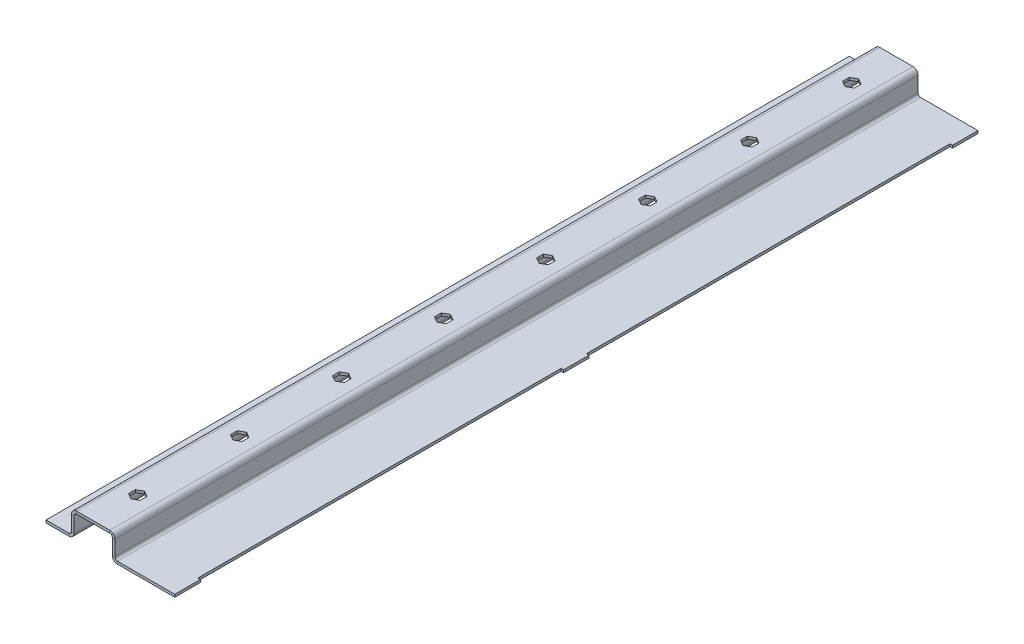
ISO-10303-21;
HEADER;
FILE_DESCRIPTION(('STEP AP214'),'2;1');
FILE_NAME('part.step','',(''),(''),'','','');
FILE_SCHEMA(('AUTOMOTIVE_DESIGN { 1 0 10303 214 1 1 1 1 }'));
ENDSEC;
DATA;
#1=APPLICATION_CONTEXT('core data for automotive mechanical design processes');
#2=APPLICATION_PROTOCOL_DEFINITION('international standard','automotive_design',2000,#1);
#3=PRODUCT_CONTEXT('',#1,'mechanical');
#4=PRODUCT('Part','Part','',(#3));
#5=PRODUCT_RELATED_PRODUCT_CATEGORY('part','',(#4));
#6=PRODUCT_DEFINITION_FORMATION('','',#4);
#7=PRODUCT_DEFINITION_CONTEXT('part definition',#1,'design');
#8=PRODUCT_DEFINITION('design','',#6,#7);
#9=PRODUCT_DEFINITION_SHAPE('','',#8);
#10=(LENGTH_UNIT() NAMED_UNIT(*) SI_UNIT(.MILLI.,.METRE.));
#11=(NAMED_UNIT(*) PLANE_ANGLE_UNIT() SI_UNIT($,.RADIAN.));
#12=(NAMED_UNIT(*) SI_UNIT($,.STERADIAN.) SOLID_ANGLE_UNIT());
#13=UNCERTAINTY_MEASURE_WITH_UNIT(LENGTH_MEASURE(1.E-05),#10,'distance_accuracy_value','');
#14=(GEOMETRIC_REPRESENTATION_CONTEXT(3) GLOBAL_UNCERTAINTY_ASSIGNED_CONTEXT((#13)) GLOBAL_UNIT_ASSIGNED_CONTEXT((#10,
#11,#12)) REPRESENTATION_CONTEXT('',''));
#15=CARTESIAN_POINT('',(0.,0.,0.));
#16=DIRECTION('',(0.,0.,1.));
#17=DIRECTION('',(1.,0.,0.));
#18=AXIS2_PLACEMENT_3D('',#15,#16,#17);
#19=CARTESIAN_POINT('',(62.0000000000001,-29.,-30.034999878));
#20=DIRECTION('',(1.,0.,0.));
#21=DIRECTION('',(0.,0.,-1.));
#22=AXIS2_PLACEMENT_3D('',#19,#20,#21);
#23=PLANE('',#22);
#24=DIRECTION('',(0.,1.,0.));
#25=VECTOR('',#24,1.);
#26=CARTESIAN_POINT('',(62.0000000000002,-29.,274.965000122));
#27=LINE('',#26,#25);
#28=CARTESIAN_POINT('',(62.0000000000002,-29.,274.965000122));
#29=VERTEX_POINT('',#28);
#30=CARTESIAN_POINT('',(62.0000000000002,-27.,274.965000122));
#31=VERTEX_POINT('',#30);
#32=EDGE_CURVE('E1194',#29,#31,#27,.T.);
#33=ORIENTED_EDGE('',*,*,#32,.F.);
#34=DIRECTION('',(0.,0.,-1.));
#35=VECTOR('',#34,1.);
#36=CARTESIAN_POINT('',(62.0000000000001,-29.,-30.034999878));
#37=LINE('',#36,#35);
#38=CARTESIAN_POINT('',(62.0000000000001,-29.,-10.034999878));
#39=VERTEX_POINT('',#38);
#40=EDGE_CURVE('E41',#29,#39,#37,.T.);
#41=ORIENTED_EDGE('',*,*,#40,.T.);
#42=DIRECTION('',(0.,1.,0.));
#43=VECTOR('',#42,1.);
#44=CARTESIAN_POINT('',(62.0000000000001,-29.,-10.034999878));
#45=LINE('',#44,#43);
#46=CARTESIAN_POINT('',(62.0000000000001,-27.,-10.034999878));
#47=VERTEX_POINT('',#46);
#48=EDGE_CURVE('E1157',#39,#47,#45,.T.);
#49=ORIENTED_EDGE('',*,*,#48,.T.);
#50=DIRECTION('',(0.,0.,-1.));
#51=VECTOR('',#50,1.);
#52=CARTESIAN_POINT('',(62.0000000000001,-27.,-30.034999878));
#53=LINE('',#52,#51);
#54=EDGE_CURVE('E548',#31,#47,#53,.T.);
#55=ORIENTED_EDGE('',*,*,#54,.F.);
#56=EDGE_LOOP('',(#33,#41,#49,#55));
#57=FACE_BOUND('',#56,.T.);
#58=ADVANCED_FACE('F37',(#57),#23,.T.);
#59=DIRECTION('',(0.,1.,0.));
#60=VECTOR('',#59,1.);
#61=CARTESIAN_POINT('',(62.0000000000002,-29.,294.965000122));
#62=LINE('',#61,#60);
#63=CARTESIAN_POINT('',(62.0000000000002,-29.,294.965000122));
#64=VERTEX_POINT('',#63);
#65=CARTESIAN_POINT('',(62.0000000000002,-27.,294.965000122));
#66=VERTEX_POINT('',#65);
#67=EDGE_CURVE('E514',#64,#66,#62,.T.);
#68=ORIENTED_EDGE('',*,*,#67,.T.);
#69=CARTESIAN_POINT('',(62.0000000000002,-26.9999999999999,579.965000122));
#70=VERTEX_POINT('',#69);
#71=EDGE_CURVE('E544',#70,#66,#53,.T.);
#72=ORIENTED_EDGE('',*,*,#71,.F.);
#73=DIRECTION('',(0.,1.,0.));
#74=VECTOR('',#73,1.);
#75=CARTESIAN_POINT('',(62.0000000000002,-28.9999999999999,579.965000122));
#76=LINE('',#75,#74);
#77=CARTESIAN_POINT('',(62.0000000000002,-28.9999999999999,579.965000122));
#78=VERTEX_POINT('',#77);
#79=EDGE_CURVE('E538',#78,#70,#76,.T.);
#80=ORIENTED_EDGE('',*,*,#79,.F.);
#81=EDGE_CURVE('E531',#78,#64,#37,.T.);
#82=ORIENTED_EDGE('',*,*,#81,.T.);
#83=EDGE_LOOP('',(#68,#72,#80,#82));
#84=FACE_BOUND('',#83,.T.);
#85=ADVANCED_FACE('F537',(#84),#23,.T.);
#86=CARTESIAN_POINT('',(40.4226451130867,-9.000000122,585.));
#87=DIRECTION('',(0.,-1.,0.));
#88=DIRECTION('',(0.,0.,-1.));
#89=AXIS2_PLACEMENT_3D('',#86,#87,#88);
#90=PLANE('',#89);
#91=DIRECTION('',(0.866025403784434,0.,-0.500000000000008));
#92=VECTOR('',#91,1.);
#93=CARTESIAN_POINT('',(1.16538018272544E-13,-9.000000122,10.2416225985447));
#94=LINE('',#93,#92);
#95=CARTESIAN_POINT('',(1.38777878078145E-13,-9.000000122,10.2416225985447));
#96=VERTEX_POINT('',#95);
#97=CARTESIAN_POINT('',(4.60000000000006,-9.000000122,7.58581136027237));
#98=VERTEX_POINT('',#97);
#99=EDGE_CURVE('E570',#96,#98,#94,.T.);
#100=ORIENTED_EDGE('',*,*,#99,.F.);
#101=DIRECTION('',(0.866025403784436,0.,0.500000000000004));
#102=VECTOR('',#101,1.);
#103=CARTESIAN_POINT('',(-4.59999999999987,-9.000000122,7.58581136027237));
#104=LINE('',#103,#102);
#105=CARTESIAN_POINT('',(-4.59999999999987,-9.000000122,7.58581136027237));
#106=VERTEX_POINT('',#105);
#107=EDGE_CURVE('E568',#106,#96,#104,.T.);
#108=ORIENTED_EDGE('',*,*,#107,.F.);
#109=DIRECTION('',(0.,0.,1.));
#110=VECTOR('',#109,1.);
#111=CARTESIAN_POINT('',(-4.59999999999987,-9.000000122,2.27418888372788));
#112=LINE('',#111,#110);
#113=CARTESIAN_POINT('',(-4.59999999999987,-9.000000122,2.27418888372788));
#114=VERTEX_POINT('',#113);
#115=EDGE_CURVE('E582',#114,#106,#112,.T.);
#116=ORIENTED_EDGE('',*,*,#115,.F.);
#117=DIRECTION('',(-0.866025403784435,0.,0.500000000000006));
#118=VECTOR('',#117,1.);
#119=CARTESIAN_POINT('',(0.,-9.000000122,-0.38162235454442));
#120=LINE('',#119,#118);
#121=CARTESIAN_POINT('',(0.,-9.000000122,-0.38162235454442));
#122=VERTEX_POINT('',#121);
#123=EDGE_CURVE('E579',#122,#114,#120,.T.);
#124=ORIENTED_EDGE('',*,*,#123,.F.);
#125=DIRECTION('',(-0.866025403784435,0.,-0.500000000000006));
#126=VECTOR('',#125,1.);
#127=CARTESIAN_POINT('',(4.60000000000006,-9.000000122,2.27418888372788));
#128=LINE('',#127,#126);
#129=CARTESIAN_POINT('',(4.60000000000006,-9.000000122,2.27418888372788));
#130=VERTEX_POINT('',#129);
#131=EDGE_CURVE('E576',#130,#122,#128,.T.);
#132=ORIENTED_EDGE('',*,*,#131,.F.);
#133=DIRECTION('',(0.,0.,-1.));
#134=VECTOR('',#133,1.);
#135=CARTESIAN_POINT('',(4.60000000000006,-9.000000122,7.58581136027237));
#136=LINE('',#135,#134);
#137=EDGE_CURVE('E573',#98,#130,#136,.T.);
#138=ORIENTED_EDGE('',*,*,#137,.F.);
#139=EDGE_LOOP('',(#100,#108,#116,#124,#132,#138));
#140=FACE_BOUND('',#139,.T.);
#141=DIRECTION('',(0.866025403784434,0.,-0.500000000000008));
#142=VECTOR('',#141,1.);
#143=CARTESIAN_POINT('',(1.22706694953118E-13,-9.000000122,90.2516225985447));
#144=LINE('',#143,#142);
#145=CARTESIAN_POINT('',(1.38777878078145E-13,-9.000000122,90.2516225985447));
#146=VERTEX_POINT('',#145);
#147=CARTESIAN_POINT('',(4.60000000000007,-9.000000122,87.5958113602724));
#148=VERTEX_POINT('',#147);
#149=EDGE_CURVE('E618',#146,#148,#144,.T.);
#150=ORIENTED_EDGE('',*,*,#149,.F.);
#151=DIRECTION('',(0.866025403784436,0.,0.500000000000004));
#152=VECTOR('',#151,1.);
#153=CARTESIAN_POINT('',(-4.59999999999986,-9.000000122,87.5958113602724));
#154=LINE('',#153,#152);
#155=CARTESIAN_POINT('',(-4.59999999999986,-9.000000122,87.5958113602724));
#156=VERTEX_POINT('',#155);
#157=EDGE_CURVE('E616',#156,#146,#154,.T.);
#158=ORIENTED_EDGE('',*,*,#157,.F.);
#159=DIRECTION('',(0.,0.,1.));
#160=VECTOR('',#159,1.);
#161=CARTESIAN_POINT('',(-4.59999999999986,-9.000000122,82.2841888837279));
#162=LINE('',#161,#160);
#163=CARTESIAN_POINT('',(-4.59999999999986,-9.000000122,82.2841888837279));
#164=VERTEX_POINT('',#163);
#165=EDGE_CURVE('E630',#164,#156,#162,.T.);
#166=ORIENTED_EDGE('',*,*,#165,.F.);
#167=DIRECTION('',(-0.866025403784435,0.,0.500000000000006));
#168=VECTOR('',#167,1.);
#169=CARTESIAN_POINT('',(1.0000571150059E-13,-9.000000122,79.6283776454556));
#170=LINE('',#169,#168);
#171=CARTESIAN_POINT('',(1.0000571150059E-13,-9.000000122,79.6283776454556));
#172=VERTEX_POINT('',#171);
#173=EDGE_CURVE('E627',#172,#164,#170,.T.);
#174=ORIENTED_EDGE('',*,*,#173,.F.);
#175=DIRECTION('',(-0.866025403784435,0.,-0.500000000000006));
#176=VECTOR('',#175,1.);
#177=CARTESIAN_POINT('',(4.60000000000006,-9.000000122,82.2841888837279));
#178=LINE('',#177,#176);
#179=CARTESIAN_POINT('',(4.60000000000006,-9.000000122,82.2841888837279));
#180=VERTEX_POINT('',#179);
#181=EDGE_CURVE('E624',#180,#172,#178,.T.);
#182=ORIENTED_EDGE('',*,*,#181,.F.);
#183=DIRECTION('',(0.,0.,-1.));
#184=VECTOR('',#183,1.);
#185=CARTESIAN_POINT('',(4.60000000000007,-9.000000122,87.5958113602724));
#186=LINE('',#185,#184);
#187=EDGE_CURVE('E621',#148,#180,#186,.T.);
#188=ORIENTED_EDGE('',*,*,#187,.F.);
#189=EDGE_LOOP('',(#150,#158,#166,#174,#182,#188));
#190=FACE_BOUND('',#189,.T.);
#191=DIRECTION('',(0.866025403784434,0.,-0.500000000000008));
#192=VECTOR('',#191,1.);
#193=CARTESIAN_POINT('',(1.28875371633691E-13,-9.000000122,170.261622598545));
#194=LINE('',#193,#192);
#195=CARTESIAN_POINT('',(1.38777878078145E-13,-9.000000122,170.261622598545));
#196=VERTEX_POINT('',#195);
#197=CARTESIAN_POINT('',(4.60000000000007,-9.000000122,167.605811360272));
#198=VERTEX_POINT('',#197);
#199=EDGE_CURVE('E666',#196,#198,#194,.T.);
#200=ORIENTED_EDGE('',*,*,#199,.F.);
#201=DIRECTION('',(0.866025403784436,0.,0.500000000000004));
#202=VECTOR('',#201,1.);
#203=CARTESIAN_POINT('',(-4.59999999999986,-9.000000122,167.605811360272));
#204=LINE('',#203,#202);
#205=CARTESIAN_POINT('',(-4.59999999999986,-9.000000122,167.605811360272));
#206=VERTEX_POINT('',#205);
#207=EDGE_CURVE('E664',#206,#196,#204,.T.);
#208=ORIENTED_EDGE('',*,*,#207,.F.);
#209=DIRECTION('',(0.,0.,1.));
#210=VECTOR('',#209,1.);
#211=CARTESIAN_POINT('',(-4.59999999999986,-9.000000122,162.294188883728));
#212=LINE('',#211,#210);
#213=CARTESIAN_POINT('',(-4.59999999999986,-9.000000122,162.294188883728));
#214=VERTEX_POINT('',#213);
#215=EDGE_CURVE('E678',#214,#206,#212,.T.);
#216=ORIENTED_EDGE('',*,*,#215,.F.);
#217=DIRECTION('',(-0.866025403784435,0.,0.500000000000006));
#218=VECTOR('',#217,1.);
#219=CARTESIAN_POINT('',(1.06174388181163E-13,-9.000000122,159.638377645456));
#220=LINE('',#219,#218);
#221=CARTESIAN_POINT('',(1.06174388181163E-13,-9.000000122,159.638377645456));
#222=VERTEX_POINT('',#221);
#223=EDGE_CURVE('E675',#222,#214,#220,.T.);
#224=ORIENTED_EDGE('',*,*,#223,.F.);
#225=DIRECTION('',(-0.866025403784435,0.,-0.500000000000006));
#226=VECTOR('',#225,1.);
#227=CARTESIAN_POINT('',(4.60000000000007,-9.000000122,162.294188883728));
#228=LINE('',#227,#226);
#229=CARTESIAN_POINT('',(4.60000000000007,-9.000000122,162.294188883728));
#230=VERTEX_POINT('',#229);
#231=EDGE_CURVE('E672',#230,#222,#228,.T.);
#232=ORIENTED_EDGE('',*,*,#231,.F.);
#233=DIRECTION('',(0.,0.,-1.));
#234=VECTOR('',#233,1.);
#235=CARTESIAN_POINT('',(4.60000000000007,-9.000000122,167.605811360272));
#236=LINE('',#235,#234);
#237=EDGE_CURVE('E669',#198,#230,#236,.T.);
#238=ORIENTED_EDGE('',*,*,#237,.F.);
#239=EDGE_LOOP('',(#200,#208,#216,#224,#232,#238));
#240=FACE_BOUND('',#239,.T.);
#241=DIRECTION('',(0.866025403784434,0.,-0.500000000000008));
#242=VECTOR('',#241,1.);
#243=CARTESIAN_POINT('',(1.35044048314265E-13,-9.000000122,250.271622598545));
#244=LINE('',#243,#242);
#245=CARTESIAN_POINT('',(1.38777878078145E-13,-9.000000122,250.271622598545));
#246=VERTEX_POINT('',#245);
#247=CARTESIAN_POINT('',(4.60000000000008,-9.000000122,247.615811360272));
#248=VERTEX_POINT('',#247);
#249=EDGE_CURVE('E714',#246,#248,#244,.T.);
#250=ORIENTED_EDGE('',*,*,#249,.F.);
#251=DIRECTION('',(0.866025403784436,0.,0.500000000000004));
#252=VECTOR('',#251,1.);
#253=CARTESIAN_POINT('',(-4.59999999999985,-9.000000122,247.615811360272));
#254=LINE('',#253,#252);
#255=CARTESIAN_POINT('',(-4.59999999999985,-9.000000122,247.615811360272));
#256=VERTEX_POINT('',#255);
#257=EDGE_CURVE('E712',#256,#246,#254,.T.);
#258=ORIENTED_EDGE('',*,*,#257,.F.);
#259=DIRECTION('',(0.,0.,1.));
#260=VECTOR('',#259,1.);
#261=CARTESIAN_POINT('',(-4.59999999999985,-9.000000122,242.304188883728));
#262=LINE('',#261,#260);
#263=CARTESIAN_POINT('',(-4.59999999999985,-9.000000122,242.304188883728));
#264=VERTEX_POINT('',#263);
#265=EDGE_CURVE('E726',#264,#256,#262,.T.);
#266=ORIENTED_EDGE('',*,*,#265,.F.);
#267=DIRECTION('',(-0.866025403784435,0.,0.500000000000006));
#268=VECTOR('',#267,1.);
#269=CARTESIAN_POINT('',(1.12343064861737E-13,-9.000000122,239.648377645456));
#270=LINE('',#269,#268);
#271=CARTESIAN_POINT('',(1.12343064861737E-13,-9.000000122,239.648377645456));
#272=VERTEX_POINT('',#271);
#273=EDGE_CURVE('E723',#272,#264,#270,.T.);
#274=ORIENTED_EDGE('',*,*,#273,.F.);
#275=DIRECTION('',(-0.866025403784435,0.,-0.500000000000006));
#276=VECTOR('',#275,1.);
#277=CARTESIAN_POINT('',(4.60000000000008,-9.000000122,242.304188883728));
#278=LINE('',#277,#276);
#279=CARTESIAN_POINT('',(4.60000000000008,-9.000000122,242.304188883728));
#280=VERTEX_POINT('',#279);
#281=EDGE_CURVE('E720',#280,#272,#278,.T.);
#282=ORIENTED_EDGE('',*,*,#281,.F.);
#283=DIRECTION('',(0.,0.,-1.));
#284=VECTOR('',#283,1.);
#285=CARTESIAN_POINT('',(4.60000000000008,-9.000000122,247.615811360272));
#286=LINE('',#285,#284);
#287=EDGE_CURVE('E717',#248,#280,#286,.T.);
#288=ORIENTED_EDGE('',*,*,#287,.F.);
#289=EDGE_LOOP('',(#250,#258,#266,#274,#282,#288));
#290=FACE_BOUND('',#289,.T.);
#291=DIRECTION('',(0.866025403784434,0.,-0.500000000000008));
#292=VECTOR('',#291,1.);
#293=CARTESIAN_POINT('',(1.41212724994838E-13,-9.000000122,330.281622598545));
#294=LINE('',#293,#292);
#295=CARTESIAN_POINT('',(1.2490009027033E-13,-9.000000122,330.281622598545));
#296=VERTEX_POINT('',#295);
#297=CARTESIAN_POINT('',(4.60000000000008,-9.000000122,327.625811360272));
#298=VERTEX_POINT('',#297);
#299=EDGE_CURVE('E762',#296,#298,#294,.T.);
#300=ORIENTED_EDGE('',*,*,#299,.F.);
#301=DIRECTION('',(0.866025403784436,0.,0.500000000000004));
#302=VECTOR('',#301,1.);
#303=CARTESIAN_POINT('',(-4.59999999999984,-9.000000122,327.625811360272));
#304=LINE('',#303,#302);
#305=CARTESIAN_POINT('',(-4.59999999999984,-9.000000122,327.625811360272));
#306=VERTEX_POINT('',#305);
#307=EDGE_CURVE('E760',#306,#296,#304,.T.);
#308=ORIENTED_EDGE('',*,*,#307,.F.);
#309=DIRECTION('',(0.,0.,1.));
#310=VECTOR('',#309,1.);
#311=CARTESIAN_POINT('',(-4.59999999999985,-9.000000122,322.314188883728));
#312=LINE('',#311,#310);
#313=CARTESIAN_POINT('',(-4.59999999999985,-9.000000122,322.314188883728));
#314=VERTEX_POINT('',#313);
#315=EDGE_CURVE('E774',#314,#306,#312,.T.);
#316=ORIENTED_EDGE('',*,*,#315,.F.);
#317=DIRECTION('',(-0.866025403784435,0.,0.500000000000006));
#318=VECTOR('',#317,1.);
#319=CARTESIAN_POINT('',(1.1851174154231E-13,-9.000000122,319.658377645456));
#320=LINE('',#319,#318);
#321=CARTESIAN_POINT('',(1.1851174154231E-13,-9.000000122,319.658377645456));
#322=VERTEX_POINT('',#321);
#323=EDGE_CURVE('E771',#322,#314,#320,.T.);
#324=ORIENTED_EDGE('',*,*,#323,.F.);
#325=DIRECTION('',(-0.866025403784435,0.,-0.500000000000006));
#326=VECTOR('',#325,1.);
#327=CARTESIAN_POINT('',(4.60000000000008,-9.000000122,322.314188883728));
#328=LINE('',#327,#326);
#329=CARTESIAN_POINT('',(4.60000000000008,-9.000000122,322.314188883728));
#330=VERTEX_POINT('',#329);
#331=EDGE_CURVE('E768',#330,#322,#328,.T.);
#332=ORIENTED_EDGE('',*,*,#331,.F.);
#333=DIRECTION('',(0.,0.,-1.));
#334=VECTOR('',#333,1.);
#335=CARTESIAN_POINT('',(4.60000000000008,-9.000000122,327.625811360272));
#336=LINE('',#335,#334);
#337=EDGE_CURVE('E765',#298,#330,#336,.T.);
#338=ORIENTED_EDGE('',*,*,#337,.F.);
#339=EDGE_LOOP('',(#300,#308,#316,#324,#332,#338));
#340=FACE_BOUND('',#339,.T.);
#341=DIRECTION('',(0.866025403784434,0.,-0.500000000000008));
#342=VECTOR('',#341,1.);
#343=CARTESIAN_POINT('',(1.47381401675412E-13,-9.000000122,410.291622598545));
#344=LINE('',#343,#342);
#345=CARTESIAN_POINT('',(1.45716771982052E-13,-9.000000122,410.291622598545));
#346=VERTEX_POINT('',#345);
#347=CARTESIAN_POINT('',(4.60000000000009,-9.000000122,407.635811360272));
#348=VERTEX_POINT('',#347);
#349=EDGE_CURVE('E810',#346,#348,#344,.T.);
#350=ORIENTED_EDGE('',*,*,#349,.F.);
#351=DIRECTION('',(0.866025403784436,0.,0.500000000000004));
#352=VECTOR('',#351,1.);
#353=CARTESIAN_POINT('',(-4.59999999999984,-9.000000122,407.635811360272));
#354=LINE('',#353,#352);
#355=CARTESIAN_POINT('',(-4.59999999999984,-9.000000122,407.635811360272));
#356=VERTEX_POINT('',#355);
#357=EDGE_CURVE('E808',#356,#346,#354,.T.);
#358=ORIENTED_EDGE('',*,*,#357,.F.);
#359=DIRECTION('',(0.,0.,1.));
#360=VECTOR('',#359,1.);
#361=CARTESIAN_POINT('',(-4.59999999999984,-9.000000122,402.324188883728));
#362=LINE('',#361,#360);
#363=CARTESIAN_POINT('',(-4.59999999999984,-9.000000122,402.324188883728));
#364=VERTEX_POINT('',#363);
#365=EDGE_CURVE('E822',#364,#356,#362,.T.);
#366=ORIENTED_EDGE('',*,*,#365,.F.);
#367=DIRECTION('',(-0.866025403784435,0.,0.500000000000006));
#368=VECTOR('',#367,1.);
#369=CARTESIAN_POINT('',(1.24680418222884E-13,-9.000000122,399.668377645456));
#370=LINE('',#369,#368);
#371=CARTESIAN_POINT('',(1.24680418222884E-13,-9.000000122,399.668377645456));
#372=VERTEX_POINT('',#371);
#373=EDGE_CURVE('E819',#372,#364,#370,.T.);
#374=ORIENTED_EDGE('',*,*,#373,.F.);
#375=DIRECTION('',(-0.866025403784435,0.,-0.500000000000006));
#376=VECTOR('',#375,1.);
#377=CARTESIAN_POINT('',(4.60000000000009,-9.000000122,402.324188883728));
#378=LINE('',#377,#376);
#379=CARTESIAN_POINT('',(4.60000000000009,-9.000000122,402.324188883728));
#380=VERTEX_POINT('',#379);
#381=EDGE_CURVE('E816',#380,#372,#378,.T.);
#382=ORIENTED_EDGE('',*,*,#381,.F.);
#383=DIRECTION('',(0.,0.,-1.));
#384=VECTOR('',#383,1.);
#385=CARTESIAN_POINT('',(4.60000000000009,-9.000000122,407.635811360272));
#386=LINE('',#385,#384);
#387=EDGE_CURVE('E813',#348,#380,#386,.T.);
#388=ORIENTED_EDGE('',*,*,#387,.F.);
#389=EDGE_LOOP('',(#350,#358,#366,#374,#382,#388));
#390=FACE_BOUND('',#389,.T.);
#391=DIRECTION('',(0.866025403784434,0.,-0.500000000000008));
#392=VECTOR('',#391,1.);
#393=CARTESIAN_POINT('',(1.53550078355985E-13,-9.000000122,490.301622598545));
#394=LINE('',#393,#392);
#395=CARTESIAN_POINT('',(1.52655665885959E-13,-9.000000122,490.301622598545));
#396=VERTEX_POINT('',#395);
#397=CARTESIAN_POINT('',(4.6000000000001,-9.000000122,487.645811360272));
#398=VERTEX_POINT('',#397);
#399=EDGE_CURVE('E858',#396,#398,#394,.T.);
#400=ORIENTED_EDGE('',*,*,#399,.F.);
#401=DIRECTION('',(0.866025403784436,0.,0.500000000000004));
#402=VECTOR('',#401,1.);
#403=CARTESIAN_POINT('',(-4.59999999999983,-9.000000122,487.645811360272));
#404=LINE('',#403,#402);
#405=CARTESIAN_POINT('',(-4.59999999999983,-9.000000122,487.645811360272));
#406=VERTEX_POINT('',#405);
#407=EDGE_CURVE('E856',#406,#396,#404,.T.);
#408=ORIENTED_EDGE('',*,*,#407,.F.);
#409=DIRECTION('',(0.,0.,1.));
#410=VECTOR('',#409,1.);
#411=CARTESIAN_POINT('',(-4.59999999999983,-9.000000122,482.334188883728));
#412=LINE('',#411,#410);
#413=CARTESIAN_POINT('',(-4.59999999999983,-9.000000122,482.334188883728));
#414=VERTEX_POINT('',#413);
#415=EDGE_CURVE('E870',#414,#406,#412,.T.);
#416=ORIENTED_EDGE('',*,*,#415,.F.);
#417=DIRECTION('',(-0.866025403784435,0.,0.500000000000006));
#418=VECTOR('',#417,1.);
#419=CARTESIAN_POINT('',(1.30849094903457E-13,-9.000000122,479.678377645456));
#420=LINE('',#419,#418);
#421=CARTESIAN_POINT('',(1.30849094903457E-13,-9.000000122,479.678377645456));
#422=VERTEX_POINT('',#421);
#423=EDGE_CURVE('E867',#422,#414,#420,.T.);
#424=ORIENTED_EDGE('',*,*,#423,.F.);
#425=DIRECTION('',(-0.866025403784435,0.,-0.500000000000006));
#426=VECTOR('',#425,1.);
#427=CARTESIAN_POINT('',(4.6000000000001,-9.000000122,482.334188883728));
#428=LINE('',#427,#426);
#429=CARTESIAN_POINT('',(4.6000000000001,-9.000000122,482.334188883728));
#430=VERTEX_POINT('',#429);
#431=EDGE_CURVE('E864',#430,#422,#428,.T.);
#432=ORIENTED_EDGE('',*,*,#431,.F.);
#433=DIRECTION('',(0.,0.,-1.));
#434=VECTOR('',#433,1.);
#435=CARTESIAN_POINT('',(4.6000000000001,-9.000000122,487.645811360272));
#436=LINE('',#435,#434);
#437=EDGE_CURVE('E861',#398,#430,#436,.T.);
#438=ORIENTED_EDGE('',*,*,#437,.F.);
#439=EDGE_LOOP('',(#400,#408,#416,#424,#432,#438));
#440=FACE_BOUND('',#439,.T.);
#441=DIRECTION('',(-1.,0.,0.));
#442=VECTOR('',#441,1.);
#443=CARTESIAN_POINT('',(80.7016343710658,-9.000000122,599.965000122));
#444=LINE('',#443,#442);
#445=CARTESIAN_POINT('',(-13.,-9.00000012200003,599.965000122));
#446=VERTEX_POINT('',#445);
#447=CARTESIAN_POINT('',(13.0000000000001,-9.000000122,599.965000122));
#448=VERTEX_POINT('',#447);
#449=EDGE_CURVE('E994',#446,#448,#444,.F.);
#450=ORIENTED_EDGE('',*,*,#449,.T.);
#451=DIRECTION('',(0.,0.,-1.));
#452=VECTOR('',#451,1.);
#453=CARTESIAN_POINT('',(13.,-9.000000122,585.));
#454=LINE('',#453,#452);
#455=CARTESIAN_POINT('',(13.0000000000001,-9.00000012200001,-30.0349998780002));
#456=VERTEX_POINT('',#455);
#457=EDGE_CURVE('E997',#456,#448,#454,.F.);
#458=ORIENTED_EDGE('',*,*,#457,.F.);
#459=DIRECTION('',(1.,0.,0.));
#460=VECTOR('',#459,1.);
#461=CARTESIAN_POINT('',(80.7016343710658,-9.000000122,-30.034999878));
#462=LINE('',#461,#460);
#463=CARTESIAN_POINT('',(-13.,-9.000000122,-30.0349998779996));
#464=VERTEX_POINT('',#463);
#465=EDGE_CURVE('E1000',#456,#464,#462,.F.);
#466=ORIENTED_EDGE('',*,*,#465,.T.);
#467=DIRECTION('',(0.,0.,1.));
#468=VECTOR('',#467,1.);
#469=CARTESIAN_POINT('',(-13.0000000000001,-9.000000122,619.058772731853));
#470=LINE('',#469,#468);
#471=EDGE_CURVE('E1003',#446,#464,#470,.F.);
#472=ORIENTED_EDGE('',*,*,#471,.F.);
#473=EDGE_LOOP('',(#450,#458,#466,#472));
#474=FACE_BOUND('',#473,.T.);
#475=DIRECTION('',(0.,0.,-1.));
#476=VECTOR('',#475,1.);
#477=CARTESIAN_POINT('',(-4.59999999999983,-9.000000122,619.058772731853));
#478=LINE('',#477,#476);
#479=CARTESIAN_POINT('',(-4.59999999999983,-9.000000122,562.344188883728));
#480=VERTEX_POINT('',#479);
#481=CARTESIAN_POINT('',(-4.59999999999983,-9.000000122,567.655811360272));
#482=VERTEX_POINT('',#481);
#483=EDGE_CURVE('E901',#480,#482,#478,.F.);
#484=ORIENTED_EDGE('',*,*,#483,.F.);
#485=DIRECTION('',(-0.866025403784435,0.,0.500000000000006));
#486=VECTOR('',#485,1.);
#487=CARTESIAN_POINT('',(1.37017771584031E-13,-9.000000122,559.688377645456));
#488=LINE('',#487,#486);
#489=CARTESIAN_POINT('',(1.38777878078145E-13,-9.000000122,559.688377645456));
#490=VERTEX_POINT('',#489);
#491=EDGE_CURVE('E899',#490,#480,#488,.T.);
#492=ORIENTED_EDGE('',*,*,#491,.F.);
#493=DIRECTION('',(-0.866025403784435,0.,-0.500000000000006));
#494=VECTOR('',#493,1.);
#495=CARTESIAN_POINT('',(4.6000000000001,-9.000000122,562.344188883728));
#496=LINE('',#495,#494);
#497=CARTESIAN_POINT('',(4.6000000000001,-9.000000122,562.344188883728));
#498=VERTEX_POINT('',#497);
#499=EDGE_CURVE('E897',#498,#490,#496,.T.);
#500=ORIENTED_EDGE('',*,*,#499,.F.);
#501=DIRECTION('',(0.,0.,-1.));
#502=VECTOR('',#501,1.);
#503=CARTESIAN_POINT('',(4.6000000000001,-9.000000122,619.058772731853));
#504=LINE('',#503,#502);
#505=CARTESIAN_POINT('',(4.6000000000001,-9.000000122,567.655811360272));
#506=VERTEX_POINT('',#505);
#507=EDGE_CURVE('E894',#506,#498,#504,.T.);
#508=ORIENTED_EDGE('',*,*,#507,.F.);
#509=DIRECTION('',(0.866025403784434,0.,-0.500000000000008));
#510=VECTOR('',#509,1.);
#511=CARTESIAN_POINT('',(1.59718755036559E-13,-9.000000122,570.311622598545));
#512=LINE('',#511,#510);
#513=CARTESIAN_POINT('',(1.59594559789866E-13,-9.000000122,570.311622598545));
#514=VERTEX_POINT('',#513);
#515=EDGE_CURVE('E890',#514,#506,#512,.T.);
#516=ORIENTED_EDGE('',*,*,#515,.F.);
#517=DIRECTION('',(0.866025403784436,0.,0.500000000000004));
#518=VECTOR('',#517,1.);
#519=CARTESIAN_POINT('',(-4.59999999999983,-9.000000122,567.655811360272));
#520=LINE('',#519,#518);
#521=EDGE_CURVE('E892',#482,#514,#520,.T.);
#522=ORIENTED_EDGE('',*,*,#521,.F.);
#523=EDGE_LOOP('',(#484,#492,#500,#508,#516,#522));
#524=FACE_BOUND('',#523,.T.);
#525=ADVANCED_FACE('F1275',(#140,#190,#240,#290,#340,#390,#440,#474,#524),#90,.F.);
#526=CARTESIAN_POINT('',(17.,-11.000000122,619.058772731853));
#527=DIRECTION('',(0.,-1.,0.));
#528=DIRECTION('',(0.,0.,-1.));
#529=AXIS2_PLACEMENT_3D('',#526,#527,#528);
#530=PLANE('',#529);
#531=DIRECTION('',(0.866025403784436,0.,0.500000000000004));
#532=VECTOR('',#531,1.);
#533=CARTESIAN_POINT('',(-4.59999999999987,-11.000000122,7.58581136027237));
#534=LINE('',#533,#532);
#535=CARTESIAN_POINT('',(-4.59999999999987,-11.000000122,7.58581136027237));
#536=VERTEX_POINT('',#535);
#537=CARTESIAN_POINT('',(1.16538018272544E-13,-11.000000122,10.2416225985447));
#538=VERTEX_POINT('',#537);
#539=EDGE_CURVE('E565',#536,#538,#534,.T.);
#540=ORIENTED_EDGE('',*,*,#539,.T.);
#541=DIRECTION('',(0.866025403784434,0.,-0.500000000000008));
#542=VECTOR('',#541,1.);
#543=CARTESIAN_POINT('',(1.16538018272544E-13,-11.000000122,10.2416225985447));
#544=LINE('',#543,#542);
#545=CARTESIAN_POINT('',(4.6000000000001,-11.000000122,7.58581136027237));
#546=VERTEX_POINT('',#545);
#547=EDGE_CURVE('E588',#538,#546,#544,.T.);
#548=ORIENTED_EDGE('',*,*,#547,.T.);
#549=DIRECTION('',(0.,0.,-1.));
#550=VECTOR('',#549,1.);
#551=CARTESIAN_POINT('',(4.60000000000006,-11.000000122,7.58581136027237));
#552=LINE('',#551,#550);
#553=CARTESIAN_POINT('',(4.60000000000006,-11.000000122,2.27418888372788));
#554=VERTEX_POINT('',#553);
#555=EDGE_CURVE('E539',#546,#554,#552,.T.);
#556=ORIENTED_EDGE('',*,*,#555,.T.);
#557=DIRECTION('',(-0.866025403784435,0.,-0.500000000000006));
#558=VECTOR('',#557,1.);
#559=CARTESIAN_POINT('',(4.60000000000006,-11.000000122,2.27418888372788));
#560=LINE('',#559,#558);
#561=CARTESIAN_POINT('',(0.,-11.000000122,-0.381622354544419));
#562=VERTEX_POINT('',#561);
#563=EDGE_CURVE('E542',#554,#562,#560,.T.);
#564=ORIENTED_EDGE('',*,*,#563,.T.);
#565=DIRECTION('',(-0.866025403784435,0.,0.500000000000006));
#566=VECTOR('',#565,1.);
#567=CARTESIAN_POINT('',(0.,-11.000000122,-0.38162235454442));
#568=LINE('',#567,#566);
#569=CARTESIAN_POINT('',(-4.59999999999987,-11.000000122,2.27418888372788));
#570=VERTEX_POINT('',#569);
#571=EDGE_CURVE('E559',#562,#570,#568,.T.);
#572=ORIENTED_EDGE('',*,*,#571,.T.);
#573=DIRECTION('',(0.,0.,1.));
#574=VECTOR('',#573,1.);
#575=CARTESIAN_POINT('',(-4.59999999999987,-11.000000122,2.27418888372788));
#576=LINE('',#575,#574);
#577=EDGE_CURVE('E562',#570,#536,#576,.T.);
#578=ORIENTED_EDGE('',*,*,#577,.T.);
#579=EDGE_LOOP('',(#540,#548,#556,#564,#572,#578));
#580=FACE_BOUND('',#579,.T.);
#581=DIRECTION('',(0.866025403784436,0.,0.500000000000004));
#582=VECTOR('',#581,1.);
#583=CARTESIAN_POINT('',(-4.59999999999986,-11.000000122,87.5958113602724));
#584=LINE('',#583,#582);
#585=CARTESIAN_POINT('',(-4.59999999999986,-11.000000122,87.5958113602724));
#586=VERTEX_POINT('',#585);
#587=CARTESIAN_POINT('',(1.22706694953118E-13,-11.000000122,90.2516225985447));
#588=VERTEX_POINT('',#587);
#589=EDGE_CURVE('E613',#586,#588,#584,.T.);
#590=ORIENTED_EDGE('',*,*,#589,.T.);
#591=DIRECTION('',(0.866025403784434,0.,-0.500000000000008));
#592=VECTOR('',#591,1.);
#593=CARTESIAN_POINT('',(1.22706694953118E-13,-11.000000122,90.2516225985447));
#594=LINE('',#593,#592);
#595=CARTESIAN_POINT('',(4.6000000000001,-11.000000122,87.5958113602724));
#596=VERTEX_POINT('',#595);
#597=EDGE_CURVE('E636',#588,#596,#594,.T.);
#598=ORIENTED_EDGE('',*,*,#597,.T.);
#599=DIRECTION('',(0.,0.,-1.));
#600=VECTOR('',#599,1.);
#601=CARTESIAN_POINT('',(4.60000000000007,-11.000000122,87.5958113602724));
#602=LINE('',#601,#600);
#603=CARTESIAN_POINT('',(4.60000000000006,-11.000000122,82.2841888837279));
#604=VERTEX_POINT('',#603);
#605=EDGE_CURVE('E601',#596,#604,#602,.T.);
#606=ORIENTED_EDGE('',*,*,#605,.T.);
#607=DIRECTION('',(-0.866025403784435,0.,-0.500000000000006));
#608=VECTOR('',#607,1.);
#609=CARTESIAN_POINT('',(4.60000000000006,-11.000000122,82.2841888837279));
#610=LINE('',#609,#608);
#611=CARTESIAN_POINT('',(0.,-11.000000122,79.6283776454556));
#612=VERTEX_POINT('',#611);
#613=EDGE_CURVE('E604',#604,#612,#610,.T.);
#614=ORIENTED_EDGE('',*,*,#613,.T.);
#615=DIRECTION('',(-0.866025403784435,0.,0.500000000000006));
#616=VECTOR('',#615,1.);
#617=CARTESIAN_POINT('',(1.0000571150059E-13,-11.000000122,79.6283776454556));
#618=LINE('',#617,#616);
#619=CARTESIAN_POINT('',(-4.59999999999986,-11.000000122,82.2841888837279));
#620=VERTEX_POINT('',#619);
#621=EDGE_CURVE('E607',#612,#620,#618,.T.);
#622=ORIENTED_EDGE('',*,*,#621,.T.);
#623=DIRECTION('',(0.,0.,1.));
#624=VECTOR('',#623,1.);
#625=CARTESIAN_POINT('',(-4.59999999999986,-11.000000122,82.2841888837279));
#626=LINE('',#625,#624);
#627=EDGE_CURVE('E610',#620,#586,#626,.T.);
#628=ORIENTED_EDGE('',*,*,#627,.T.);
#629=EDGE_LOOP('',(#590,#598,#606,#614,#622,#628));
#630=FACE_BOUND('',#629,.T.);
#631=DIRECTION('',(0.866025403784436,0.,0.500000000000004));
#632=VECTOR('',#631,1.);
#633=CARTESIAN_POINT('',(-4.59999999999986,-11.000000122,167.605811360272));
#634=LINE('',#633,#632);
#635=CARTESIAN_POINT('',(-4.59999999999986,-11.000000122,167.605811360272));
#636=VERTEX_POINT('',#635);
#637=CARTESIAN_POINT('',(1.28875371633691E-13,-11.000000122,170.261622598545));
#638=VERTEX_POINT('',#637);
#639=EDGE_CURVE('E661',#636,#638,#634,.T.);
#640=ORIENTED_EDGE('',*,*,#639,.T.);
#641=DIRECTION('',(0.866025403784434,0.,-0.500000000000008));
#642=VECTOR('',#641,1.);
#643=CARTESIAN_POINT('',(1.28875371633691E-13,-11.000000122,170.261622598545));
#644=LINE('',#643,#642);
#645=CARTESIAN_POINT('',(4.60000000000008,-11.000000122,167.605811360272));
#646=VERTEX_POINT('',#645);
#647=EDGE_CURVE('E684',#638,#646,#644,.T.);
#648=ORIENTED_EDGE('',*,*,#647,.T.);
#649=DIRECTION('',(0.,0.,-1.));
#650=VECTOR('',#649,1.);
#651=CARTESIAN_POINT('',(4.60000000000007,-11.000000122,167.605811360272));
#652=LINE('',#651,#650);
#653=CARTESIAN_POINT('',(4.60000000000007,-11.000000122,162.294188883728));
#654=VERTEX_POINT('',#653);
#655=EDGE_CURVE('E649',#646,#654,#652,.T.);
#656=ORIENTED_EDGE('',*,*,#655,.T.);
#657=DIRECTION('',(-0.866025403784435,0.,-0.500000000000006));
#658=VECTOR('',#657,1.);
#659=CARTESIAN_POINT('',(4.60000000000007,-11.000000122,162.294188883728));
#660=LINE('',#659,#658);
#661=CARTESIAN_POINT('',(1.05818132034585E-13,-11.000000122,159.638377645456));
#662=VERTEX_POINT('',#661);
#663=EDGE_CURVE('E652',#654,#662,#660,.T.);
#664=ORIENTED_EDGE('',*,*,#663,.T.);
#665=DIRECTION('',(-0.866025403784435,0.,0.500000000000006));
#666=VECTOR('',#665,1.);
#667=CARTESIAN_POINT('',(1.06174388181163E-13,-11.000000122,159.638377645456));
#668=LINE('',#667,#666);
#669=CARTESIAN_POINT('',(-4.59999999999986,-11.000000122,162.294188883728));
#670=VERTEX_POINT('',#669);
#671=EDGE_CURVE('E655',#662,#670,#668,.T.);
#672=ORIENTED_EDGE('',*,*,#671,.T.);
#673=DIRECTION('',(0.,0.,1.));
#674=VECTOR('',#673,1.);
#675=CARTESIAN_POINT('',(-4.59999999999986,-11.000000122,162.294188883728));
#676=LINE('',#675,#674);
#677=EDGE_CURVE('E658',#670,#636,#676,.T.);
#678=ORIENTED_EDGE('',*,*,#677,.T.);
#679=EDGE_LOOP('',(#640,#648,#656,#664,#672,#678));
#680=FACE_BOUND('',#679,.T.);
#681=DIRECTION('',(0.866025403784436,0.,0.500000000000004));
#682=VECTOR('',#681,1.);
#683=CARTESIAN_POINT('',(-4.59999999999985,-11.000000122,247.615811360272));
#684=LINE('',#683,#682);
#685=CARTESIAN_POINT('',(-4.59999999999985,-11.000000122,247.615811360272));
#686=VERTEX_POINT('',#685);
#687=CARTESIAN_POINT('',(1.35044048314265E-13,-11.000000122,250.271622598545));
#688=VERTEX_POINT('',#687);
#689=EDGE_CURVE('E709',#686,#688,#684,.T.);
#690=ORIENTED_EDGE('',*,*,#689,.T.);
#691=DIRECTION('',(0.866025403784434,0.,-0.500000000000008));
#692=VECTOR('',#691,1.);
#693=CARTESIAN_POINT('',(1.35044048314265E-13,-11.000000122,250.271622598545));
#694=LINE('',#693,#692);
#695=CARTESIAN_POINT('',(4.60000000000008,-11.000000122,247.615811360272));
#696=VERTEX_POINT('',#695);
#697=EDGE_CURVE('E732',#688,#696,#694,.T.);
#698=ORIENTED_EDGE('',*,*,#697,.T.);
#699=DIRECTION('',(0.,0.,-1.));
#700=VECTOR('',#699,1.);
#701=CARTESIAN_POINT('',(4.60000000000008,-11.000000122,247.615811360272));
#702=LINE('',#701,#700);
#703=CARTESIAN_POINT('',(4.60000000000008,-11.000000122,242.304188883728));
#704=VERTEX_POINT('',#703);
#705=EDGE_CURVE('E697',#696,#704,#702,.T.);
#706=ORIENTED_EDGE('',*,*,#705,.T.);
#707=DIRECTION('',(-0.866025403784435,0.,-0.500000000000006));
#708=VECTOR('',#707,1.);
#709=CARTESIAN_POINT('',(4.60000000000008,-11.000000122,242.304188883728));
#710=LINE('',#709,#708);
#711=CARTESIAN_POINT('',(1.11889664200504E-13,-11.000000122,239.648377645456));
#712=VERTEX_POINT('',#711);
#713=EDGE_CURVE('E700',#704,#712,#710,.T.);
#714=ORIENTED_EDGE('',*,*,#713,.T.);
#715=DIRECTION('',(-0.866025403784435,0.,0.500000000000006));
#716=VECTOR('',#715,1.);
#717=CARTESIAN_POINT('',(1.12343064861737E-13,-11.000000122,239.648377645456));
#718=LINE('',#717,#716);
#719=CARTESIAN_POINT('',(-4.59999999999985,-11.000000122,242.304188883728));
#720=VERTEX_POINT('',#719);
#721=EDGE_CURVE('E703',#712,#720,#718,.T.);
#722=ORIENTED_EDGE('',*,*,#721,.T.);
#723=DIRECTION('',(0.,0.,1.));
#724=VECTOR('',#723,1.);
#725=CARTESIAN_POINT('',(-4.59999999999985,-11.000000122,242.304188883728));
#726=LINE('',#725,#724);
#727=EDGE_CURVE('E706',#720,#686,#726,.T.);
#728=ORIENTED_EDGE('',*,*,#727,.T.);
#729=EDGE_LOOP('',(#690,#698,#706,#714,#722,#728));
#730=FACE_BOUND('',#729,.T.);
#731=DIRECTION('',(0.866025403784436,0.,0.500000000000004));
#732=VECTOR('',#731,1.);
#733=CARTESIAN_POINT('',(-4.59999999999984,-11.000000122,327.625811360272));
#734=LINE('',#733,#732);
#735=CARTESIAN_POINT('',(-4.59999999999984,-11.000000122,327.625811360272));
#736=VERTEX_POINT('',#735);
#737=CARTESIAN_POINT('',(1.41212724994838E-13,-11.000000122,330.281622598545));
#738=VERTEX_POINT('',#737);
#739=EDGE_CURVE('E757',#736,#738,#734,.T.);
#740=ORIENTED_EDGE('',*,*,#739,.T.);
#741=DIRECTION('',(0.866025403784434,0.,-0.500000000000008));
#742=VECTOR('',#741,1.);
#743=CARTESIAN_POINT('',(1.41212724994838E-13,-11.000000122,330.281622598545));
#744=LINE('',#743,#742);
#745=CARTESIAN_POINT('',(4.60000000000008,-11.000000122,327.625811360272));
#746=VERTEX_POINT('',#745);
#747=EDGE_CURVE('E780',#738,#746,#744,.T.);
#748=ORIENTED_EDGE('',*,*,#747,.T.);
#749=DIRECTION('',(0.,0.,-1.));
#750=VECTOR('',#749,1.);
#751=CARTESIAN_POINT('',(4.60000000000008,-11.000000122,327.625811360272));
#752=LINE('',#751,#750);
#753=CARTESIAN_POINT('',(4.60000000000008,-11.000000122,322.314188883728));
#754=VERTEX_POINT('',#753);
#755=EDGE_CURVE('E745',#746,#754,#752,.T.);
#756=ORIENTED_EDGE('',*,*,#755,.T.);
#757=DIRECTION('',(-0.866025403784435,0.,-0.500000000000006));
#758=VECTOR('',#757,1.);
#759=CARTESIAN_POINT('',(4.60000000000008,-11.000000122,322.314188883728));
#760=LINE('',#759,#758);
#761=CARTESIAN_POINT('',(1.17961196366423E-13,-11.000000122,319.658377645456));
#762=VERTEX_POINT('',#761);
#763=EDGE_CURVE('E748',#754,#762,#760,.T.);
#764=ORIENTED_EDGE('',*,*,#763,.T.);
#765=DIRECTION('',(-0.866025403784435,0.,0.500000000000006));
#766=VECTOR('',#765,1.);
#767=CARTESIAN_POINT('',(1.1851174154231E-13,-11.000000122,319.658377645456));
#768=LINE('',#767,#766);
#769=CARTESIAN_POINT('',(-4.59999999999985,-11.000000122,322.314188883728));
#770=VERTEX_POINT('',#769);
#771=EDGE_CURVE('E751',#762,#770,#768,.T.);
#772=ORIENTED_EDGE('',*,*,#771,.T.);
#773=DIRECTION('',(0.,0.,1.));
#774=VECTOR('',#773,1.);
#775=CARTESIAN_POINT('',(-4.59999999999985,-11.000000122,322.314188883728));
#776=LINE('',#775,#774);
#777=EDGE_CURVE('E754',#770,#736,#776,.T.);
#778=ORIENTED_EDGE('',*,*,#777,.T.);
#779=EDGE_LOOP('',(#740,#748,#756,#764,#772,#778));
#780=FACE_BOUND('',#779,.T.);
#781=DIRECTION('',(0.866025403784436,0.,0.500000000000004));
#782=VECTOR('',#781,1.);
#783=CARTESIAN_POINT('',(-4.59999999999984,-11.000000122,407.635811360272));
#784=LINE('',#783,#782);
#785=CARTESIAN_POINT('',(-4.59999999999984,-11.000000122,407.635811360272));
#786=VERTEX_POINT('',#785);
#787=CARTESIAN_POINT('',(1.47381401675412E-13,-11.000000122,410.291622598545));
#788=VERTEX_POINT('',#787);
#789=EDGE_CURVE('E805',#786,#788,#784,.T.);
#790=ORIENTED_EDGE('',*,*,#789,.T.);
#791=DIRECTION('',(0.866025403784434,0.,-0.500000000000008));
#792=VECTOR('',#791,1.);
#793=CARTESIAN_POINT('',(1.47381401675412E-13,-11.000000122,410.291622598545));
#794=LINE('',#793,#792);
#795=CARTESIAN_POINT('',(4.60000000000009,-11.000000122,407.635811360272));
#796=VERTEX_POINT('',#795);
#797=EDGE_CURVE('E828',#788,#796,#794,.T.);
#798=ORIENTED_EDGE('',*,*,#797,.T.);
#799=DIRECTION('',(0.,0.,-1.));
#800=VECTOR('',#799,1.);
#801=CARTESIAN_POINT('',(4.60000000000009,-11.000000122,407.635811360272));
#802=LINE('',#801,#800);
#803=CARTESIAN_POINT('',(4.60000000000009,-11.000000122,402.324188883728));
#804=VERTEX_POINT('',#803);
#805=EDGE_CURVE('E793',#796,#804,#802,.T.);
#806=ORIENTED_EDGE('',*,*,#805,.T.);
#807=DIRECTION('',(-0.866025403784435,0.,-0.500000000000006));
#808=VECTOR('',#807,1.);
#809=CARTESIAN_POINT('',(4.60000000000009,-11.000000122,402.324188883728));
#810=LINE('',#809,#808);
#811=CARTESIAN_POINT('',(1.24032728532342E-13,-11.000000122,399.668377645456));
#812=VERTEX_POINT('',#811);
#813=EDGE_CURVE('E796',#804,#812,#810,.T.);
#814=ORIENTED_EDGE('',*,*,#813,.T.);
#815=DIRECTION('',(-0.866025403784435,0.,0.500000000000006));
#816=VECTOR('',#815,1.);
#817=CARTESIAN_POINT('',(1.24680418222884E-13,-11.000000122,399.668377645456));
#818=LINE('',#817,#816);
#819=CARTESIAN_POINT('',(-4.59999999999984,-11.000000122,402.324188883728));
#820=VERTEX_POINT('',#819);
#821=EDGE_CURVE('E799',#812,#820,#818,.T.);
#822=ORIENTED_EDGE('',*,*,#821,.T.);
#823=DIRECTION('',(0.,0.,1.));
#824=VECTOR('',#823,1.);
#825=CARTESIAN_POINT('',(-4.59999999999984,-11.000000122,402.324188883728));
#826=LINE('',#825,#824);
#827=EDGE_CURVE('E802',#820,#786,#826,.T.);
#828=ORIENTED_EDGE('',*,*,#827,.T.);
#829=EDGE_LOOP('',(#790,#798,#806,#814,#822,#828));
#830=FACE_BOUND('',#829,.T.);
#831=DIRECTION('',(0.866025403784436,0.,0.500000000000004));
#832=VECTOR('',#831,1.);
#833=CARTESIAN_POINT('',(-4.59999999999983,-11.000000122,487.645811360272));
#834=LINE('',#833,#832);
#835=CARTESIAN_POINT('',(-4.59999999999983,-11.000000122,487.645811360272));
#836=VERTEX_POINT('',#835);
#837=CARTESIAN_POINT('',(1.53550078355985E-13,-11.000000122,490.301622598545));
#838=VERTEX_POINT('',#837);
#839=EDGE_CURVE('E853',#836,#838,#834,.T.);
#840=ORIENTED_EDGE('',*,*,#839,.T.);
#841=DIRECTION('',(0.866025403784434,0.,-0.500000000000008));
#842=VECTOR('',#841,1.);
#843=CARTESIAN_POINT('',(1.53550078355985E-13,-11.000000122,490.301622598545));
#844=LINE('',#843,#842);
#845=CARTESIAN_POINT('',(4.6000000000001,-11.000000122,487.645811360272));
#846=VERTEX_POINT('',#845);
#847=EDGE_CURVE('E876',#838,#846,#844,.T.);
#848=ORIENTED_EDGE('',*,*,#847,.T.);
#849=DIRECTION('',(0.,0.,-1.));
#850=VECTOR('',#849,1.);
#851=CARTESIAN_POINT('',(4.6000000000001,-11.000000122,487.645811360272));
#852=LINE('',#851,#850);
#853=CARTESIAN_POINT('',(4.6000000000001,-11.000000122,482.334188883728));
#854=VERTEX_POINT('',#853);
#855=EDGE_CURVE('E841',#846,#854,#852,.T.);
#856=ORIENTED_EDGE('',*,*,#855,.T.);
#857=DIRECTION('',(-0.866025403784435,0.,-0.500000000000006));
#858=VECTOR('',#857,1.);
#859=CARTESIAN_POINT('',(4.6000000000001,-11.000000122,482.334188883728));
#860=LINE('',#859,#858);
#861=CARTESIAN_POINT('',(1.30971622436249E-13,-11.000000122,479.678377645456));
#862=VERTEX_POINT('',#861);
#863=EDGE_CURVE('E844',#854,#862,#860,.T.);
#864=ORIENTED_EDGE('',*,*,#863,.T.);
#865=DIRECTION('',(-0.866025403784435,0.,0.500000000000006));
#866=VECTOR('',#865,1.);
#867=CARTESIAN_POINT('',(1.30849094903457E-13,-11.000000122,479.678377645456));
#868=LINE('',#867,#866);
#869=CARTESIAN_POINT('',(-4.59999999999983,-11.000000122,482.334188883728));
#870=VERTEX_POINT('',#869);
#871=EDGE_CURVE('E847',#862,#870,#868,.T.);
#872=ORIENTED_EDGE('',*,*,#871,.T.);
#873=DIRECTION('',(0.,0.,1.));
#874=VECTOR('',#873,1.);
#875=CARTESIAN_POINT('',(-4.59999999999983,-11.000000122,482.334188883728));
#876=LINE('',#875,#874);
#877=EDGE_CURVE('E850',#870,#836,#876,.T.);
#878=ORIENTED_EDGE('',*,*,#877,.T.);
#879=EDGE_LOOP('',(#840,#848,#856,#864,#872,#878));
#880=FACE_BOUND('',#879,.T.);
#881=DIRECTION('',(1.,0.,0.));
#882=VECTOR('',#881,1.);
#883=CARTESIAN_POINT('',(80.7016343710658,-11.000000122,-30.034999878));
#884=LINE('',#883,#882);
#885=CARTESIAN_POINT('',(-13.,-11.000000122,-30.034999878));
#886=VERTEX_POINT('',#885);
#887=CARTESIAN_POINT('',(13.0000000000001,-11.000000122,-30.0349998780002));
#888=VERTEX_POINT('',#887);
#889=EDGE_CURVE('E979',#886,#888,#884,.T.);
#890=ORIENTED_EDGE('',*,*,#889,.T.);
#891=DIRECTION('',(0.,0.,-1.));
#892=VECTOR('',#891,1.);
#893=CARTESIAN_POINT('',(13.0000000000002,-11.000000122,619.058772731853));
#894=LINE('',#893,#892);
#895=CARTESIAN_POINT('',(13.0000000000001,-11.0000001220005,599.965000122));
#896=VERTEX_POINT('',#895);
#897=EDGE_CURVE('E985',#888,#896,#894,.F.);
#898=ORIENTED_EDGE('',*,*,#897,.T.);
#899=DIRECTION('',(-1.,0.,0.));
#900=VECTOR('',#899,1.);
#901=CARTESIAN_POINT('',(80.7016343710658,-11.000000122,599.965000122));
#902=LINE('',#901,#900);
#903=CARTESIAN_POINT('',(-13.,-11.000000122,599.965000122));
#904=VERTEX_POINT('',#903);
#905=EDGE_CURVE('E988',#896,#904,#902,.T.);
#906=ORIENTED_EDGE('',*,*,#905,.T.);
#907=DIRECTION('',(0.,0.,-1.));
#908=VECTOR('',#907,1.);
#909=CARTESIAN_POINT('',(-13.,-11.000000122,619.058772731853));
#910=LINE('',#909,#908);
#911=EDGE_CURVE('E991',#904,#886,#910,.T.);
#912=ORIENTED_EDGE('',*,*,#911,.T.);
#913=EDGE_LOOP('',(#890,#898,#906,#912));
#914=FACE_BOUND('',#913,.T.);
#915=DIRECTION('',(-0.866025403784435,0.,0.500000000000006));
#916=VECTOR('',#915,1.);
#917=CARTESIAN_POINT('',(1.37017771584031E-13,-11.000000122,559.688377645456));
#918=LINE('',#917,#916);
#919=CARTESIAN_POINT('',(1.37043154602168E-13,-11.000000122,559.688377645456));
#920=VERTEX_POINT('',#919);
#921=CARTESIAN_POINT('',(-4.59999999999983,-11.000000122,562.344188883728));
#922=VERTEX_POINT('',#921);
#923=EDGE_CURVE('E913',#920,#922,#918,.T.);
#924=ORIENTED_EDGE('',*,*,#923,.T.);
#925=DIRECTION('',(0.,0.,1.));
#926=VECTOR('',#925,1.);
#927=CARTESIAN_POINT('',(-4.59999999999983,-11.000000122,562.344188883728));
#928=LINE('',#927,#926);
#929=CARTESIAN_POINT('',(-4.59999999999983,-11.000000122,567.655811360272));
#930=VERTEX_POINT('',#929);
#931=EDGE_CURVE('E910',#922,#930,#928,.T.);
#932=ORIENTED_EDGE('',*,*,#931,.T.);
#933=DIRECTION('',(0.866025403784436,0.,0.500000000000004));
#934=VECTOR('',#933,1.);
#935=CARTESIAN_POINT('',(-4.59999999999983,-11.000000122,567.655811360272));
#936=LINE('',#935,#934);
#937=CARTESIAN_POINT('',(1.66533453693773E-13,-11.000000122,570.311622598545));
#938=VERTEX_POINT('',#937);
#939=EDGE_CURVE('E907',#930,#938,#936,.T.);
#940=ORIENTED_EDGE('',*,*,#939,.T.);
#941=DIRECTION('',(0.866025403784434,0.,-0.500000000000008));
#942=VECTOR('',#941,1.);
#943=CARTESIAN_POINT('',(1.59718755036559E-13,-11.000000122,570.311622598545));
#944=LINE('',#943,#942);
#945=CARTESIAN_POINT('',(4.6000000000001,-11.000000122,567.655811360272));
#946=VERTEX_POINT('',#945);
#947=EDGE_CURVE('E889',#938,#946,#944,.T.);
#948=ORIENTED_EDGE('',*,*,#947,.T.);
#949=DIRECTION('',(0.,0.,-1.));
#950=VECTOR('',#949,1.);
#951=CARTESIAN_POINT('',(4.6000000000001,-11.000000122,567.655811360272));
#952=LINE('',#951,#950);
#953=CARTESIAN_POINT('',(4.6000000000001,-11.000000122,562.344188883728));
#954=VERTEX_POINT('',#953);
#955=EDGE_CURVE('E893',#946,#954,#952,.T.);
#956=ORIENTED_EDGE('',*,*,#955,.T.);
#957=DIRECTION('',(-0.866025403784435,0.,-0.500000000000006));
#958=VECTOR('',#957,1.);
#959=CARTESIAN_POINT('',(4.6000000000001,-11.000000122,562.344188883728));
#960=LINE('',#959,#958);
#961=EDGE_CURVE('E916',#954,#920,#960,.T.);
#962=ORIENTED_EDGE('',*,*,#961,.T.);
#963=EDGE_LOOP('',(#924,#932,#940,#948,#956,#962));
#964=FACE_BOUND('',#963,.T.);
#965=ADVANCED_FACE('F1256',(#580,#630,#680,#730,#780,#830,#880,#914,#964),#530,.T.);
#966=CARTESIAN_POINT('',(80.7016343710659,1233.51418080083,599.965000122));
#967=DIRECTION('',(0.,0.,-1.));
#968=DIRECTION('',(-1.,0.,0.));
#969=AXIS2_PLACEMENT_3D('',#966,#967,#968);
#970=PLANE('',#969);
#971=DIRECTION('',(0.,-1.,0.));
#972=VECTOR('',#971,1.);
#973=CARTESIAN_POINT('',(19.0000000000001,1233.51418080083,599.965000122));
#974=LINE('',#973,#972);
#975=CARTESIAN_POINT('',(19.0000000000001,-27.,599.965000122));
#976=VERTEX_POINT('',#975);
#977=CARTESIAN_POINT('',(19.0000000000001,-29.,599.965000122));
#978=VERTEX_POINT('',#977);
#979=EDGE_CURVE('E1142',#976,#978,#974,.T.);
#980=ORIENTED_EDGE('',*,*,#979,.T.);
#981=DIRECTION('',(1.,0.,0.));
#982=VECTOR('',#981,1.);
#983=CARTESIAN_POINT('',(42.0000000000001,-28.9999999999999,599.965000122));
#984=LINE('',#983,#982);
#985=CARTESIAN_POINT('',(64.0000000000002,-28.9999999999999,599.965000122));
#986=VERTEX_POINT('',#985);
#987=EDGE_CURVE('E1138',#978,#986,#984,.T.);
#988=ORIENTED_EDGE('',*,*,#987,.T.);
#989=DIRECTION('',(0.,1.,0.));
#990=VECTOR('',#989,1.);
#991=CARTESIAN_POINT('',(64.0000000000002,-28.9999999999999,599.965000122));
#992=LINE('',#991,#990);
#993=CARTESIAN_POINT('',(64.0000000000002,-26.9999999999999,599.965000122));
#994=VERTEX_POINT('',#993);
#995=EDGE_CURVE('E1205',#986,#994,#992,.T.);
#996=ORIENTED_EDGE('',*,*,#995,.T.);
#997=DIRECTION('',(-1.,0.,0.));
#998=VECTOR('',#997,1.);
#999=CARTESIAN_POINT('',(80.7016343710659,-26.9999999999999,599.965000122));
#1000=LINE('',#999,#998);
#1001=EDGE_CURVE('E11',#976,#994,#1000,.F.);
#1002=ORIENTED_EDGE('',*,*,#1001,.F.);
#1003=EDGE_LOOP('',(#980,#988,#996,#1002));
#1004=FACE_BOUND('',#1003,.T.);
#1005=ADVANCED_FACE('F1214',(#1004),#970,.F.);
#1006=CARTESIAN_POINT('',(42.0000000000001,-29.,15.));
#1007=DIRECTION('',(0.,1.,0.));
#1008=DIRECTION('',(0.,0.,1.));
#1009=AXIS2_PLACEMENT_3D('',#1006,#1007,#1008);
#1010=PLANE('',#1009);
#1011=DIRECTION('',(1.,0.,0.));
#1012=VECTOR('',#1011,1.);
#1013=CARTESIAN_POINT('',(42.0000000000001,-29.,-30.034999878));
#1014=LINE('',#1013,#1012);
#1015=CARTESIAN_POINT('',(64.0000000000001,-29.,-30.034999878));
#1016=VERTEX_POINT('',#1015);
#1017=CARTESIAN_POINT('',(19.0000000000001,-29.,-30.034999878));
#1018=VERTEX_POINT('',#1017);
#1019=EDGE_CURVE('E1133',#1016,#1018,#1014,.F.);
#1020=ORIENTED_EDGE('',*,*,#1019,.F.);
#1021=DIRECTION('',(0.,0.,-1.));
#1022=VECTOR('',#1021,1.);
#1023=CARTESIAN_POINT('',(64.0000000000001,-29.,-30.034999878));
#1024=LINE('',#1023,#1022);
#1025=CARTESIAN_POINT('',(64.0000000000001,-29.,-10.034999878));
#1026=VERTEX_POINT('',#1025);
#1027=EDGE_CURVE('E1161',#1026,#1016,#1024,.T.);
#1028=ORIENTED_EDGE('',*,*,#1027,.F.);
#1029=DIRECTION('',(1.,0.,0.));
#1030=VECTOR('',#1029,1.);
#1031=CARTESIAN_POINT('',(62.0000000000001,-29.,-10.034999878));
#1032=LINE('',#1031,#1030);
#1033=EDGE_CURVE('E1162',#39,#1026,#1032,.T.);
#1034=ORIENTED_EDGE('',*,*,#1033,.F.);
#1035=ORIENTED_EDGE('',*,*,#40,.F.);
#1036=DIRECTION('',(-1.,0.,0.));
#1037=VECTOR('',#1036,1.);
#1038=CARTESIAN_POINT('',(64.0000000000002,-29.,274.965000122));
#1039=LINE('',#1038,#1037);
#1040=CARTESIAN_POINT('',(64.0000000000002,-29.,274.965000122));
#1041=VERTEX_POINT('',#1040);
#1042=EDGE_CURVE('E524',#1041,#29,#1039,.T.);
#1043=ORIENTED_EDGE('',*,*,#1042,.F.);
#1044=DIRECTION('',(0.,0.,-1.));
#1045=VECTOR('',#1044,1.);
#1046=CARTESIAN_POINT('',(64.0000000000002,-29.,274.965000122));
#1047=LINE('',#1046,#1045);
#1048=CARTESIAN_POINT('',(64.0000000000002,-29.,294.965000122));
#1049=VERTEX_POINT('',#1048);
#1050=EDGE_CURVE('E534',#1049,#1041,#1047,.T.);
#1051=ORIENTED_EDGE('',*,*,#1050,.F.);
#1052=DIRECTION('',(1.,0.,0.));
#1053=VECTOR('',#1052,1.);
#1054=CARTESIAN_POINT('',(64.0000000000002,-29.,294.965000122));
#1055=LINE('',#1054,#1053);
#1056=EDGE_CURVE('E517',#64,#1049,#1055,.T.);
#1057=ORIENTED_EDGE('',*,*,#1056,.F.);
#1058=ORIENTED_EDGE('',*,*,#81,.F.);
#1059=DIRECTION('',(-1.,0.,0.));
#1060=VECTOR('',#1059,1.);
#1061=CARTESIAN_POINT('',(62.0000000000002,-28.9999999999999,579.965000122));
#1062=LINE('',#1061,#1060);
#1063=CARTESIAN_POINT('',(64.0000000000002,-28.9999999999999,579.965000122));
#1064=VERTEX_POINT('',#1063);
#1065=EDGE_CURVE('E1203',#1064,#78,#1062,.T.);
#1066=ORIENTED_EDGE('',*,*,#1065,.F.);
#1067=DIRECTION('',(0.,0.,-1.));
#1068=VECTOR('',#1067,1.);
#1069=CARTESIAN_POINT('',(64.0000000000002,-28.9999999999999,599.965000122));
#1070=LINE('',#1069,#1068);
#1071=EDGE_CURVE('E1200',#986,#1064,#1070,.T.);
#1072=ORIENTED_EDGE('',*,*,#1071,.F.);
#1073=ORIENTED_EDGE('',*,*,#987,.F.);
#1074=DIRECTION('',(0.,0.,1.));
#1075=VECTOR('',#1074,1.);
#1076=CARTESIAN_POINT('',(19.0000000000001,-29.,15.));
#1077=LINE('',#1076,#1075);
#1078=EDGE_CURVE('E1146',#1018,#978,#1077,.T.);
#1079=ORIENTED_EDGE('',*,*,#1078,.F.);
#1080=EDGE_LOOP('',(#1020,#1028,#1034,#1035,#1043,#1051,#1057,#1058,#1066,#1072,#1073,#1079));
#1081=FACE_BOUND('',#1080,.T.);
#1082=ADVANCED_FACE('F529',(#1081),#1010,.F.);
#1083=CARTESIAN_POINT('',(80.7016343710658,1233.51418080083,-30.0349998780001));
#1084=DIRECTION('',(0.,0.,1.));
#1085=DIRECTION('',(1.,0.,0.));
#1086=AXIS2_PLACEMENT_3D('',#1083,#1084,#1085);
#1087=PLANE('',#1086);
#1088=DIRECTION('',(1.,0.,0.));
#1089=VECTOR('',#1088,1.);
#1090=CARTESIAN_POINT('',(80.7016343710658,-27.,-30.034999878));
#1091=LINE('',#1090,#1089);
#1092=CARTESIAN_POINT('',(64.0000000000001,-27.,-30.034999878));
#1093=VERTEX_POINT('',#1092);
#1094=CARTESIAN_POINT('',(19.0000000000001,-27.,-30.034999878));
#1095=VERTEX_POINT('',#1094);
#1096=EDGE_CURVE('E1130',#1093,#1095,#1091,.F.);
#1097=ORIENTED_EDGE('',*,*,#1096,.F.);
#1098=DIRECTION('',(0.,1.,0.));
#1099=VECTOR('',#1098,1.);
#1100=CARTESIAN_POINT('',(64.0000000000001,-29.,-30.034999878));
#1101=LINE('',#1100,#1099);
#1102=EDGE_CURVE('E1175',#1016,#1093,#1101,.T.);
#1103=ORIENTED_EDGE('',*,*,#1102,.F.);
#1104=ORIENTED_EDGE('',*,*,#1019,.T.);
#1105=DIRECTION('',(0.,-1.,0.));
#1106=VECTOR('',#1105,1.);
#1107=CARTESIAN_POINT('',(19.0000000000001,1233.51418080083,-30.0349998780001));
#1108=LINE('',#1107,#1106);
#1109=EDGE_CURVE('E1096',#1095,#1018,#1108,.T.);
#1110=ORIENTED_EDGE('',*,*,#1109,.F.);
#1111=EDGE_LOOP('',(#1097,#1103,#1104,#1110));
#1112=FACE_BOUND('',#1111,.T.);
#1113=ADVANCED_FACE('F1862',(#1112),#1087,.F.);
#1114=CARTESIAN_POINT('',(42.0000000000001,-27.,15.));
#1115=DIRECTION('',(0.,1.,0.));
#1116=DIRECTION('',(0.,0.,1.));
#1117=AXIS2_PLACEMENT_3D('',#1114,#1115,#1116);
#1118=PLANE('',#1117);
#1119=ORIENTED_EDGE('',*,*,#1001,.T.);
#1120=DIRECTION('',(0.,0.,-1.));
#1121=VECTOR('',#1120,1.);
#1122=CARTESIAN_POINT('',(64.0000000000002,-26.9999999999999,599.965000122));
#1123=LINE('',#1122,#1121);
#1124=CARTESIAN_POINT('',(64.0000000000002,-26.9999999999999,579.965000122));
#1125=VERTEX_POINT('',#1124);
#1126=EDGE_CURVE('E1196',#994,#1125,#1123,.T.);
#1127=ORIENTED_EDGE('',*,*,#1126,.T.);
#1128=DIRECTION('',(-1.,0.,0.));
#1129=VECTOR('',#1128,1.);
#1130=CARTESIAN_POINT('',(62.0000000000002,-26.9999999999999,579.965000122));
#1131=LINE('',#1130,#1129);
#1132=EDGE_CURVE('E62',#1125,#70,#1131,.T.);
#1133=ORIENTED_EDGE('',*,*,#1132,.T.);
#1134=ORIENTED_EDGE('',*,*,#71,.T.);
#1135=DIRECTION('',(1.,0.,0.));
#1136=VECTOR('',#1135,1.);
#1137=CARTESIAN_POINT('',(64.0000000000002,-27.,294.965000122));
#1138=LINE('',#1137,#1136);
#1139=CARTESIAN_POINT('',(64.0000000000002,-27.,294.965000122));
#1140=VERTEX_POINT('',#1139);
#1141=EDGE_CURVE('E519',#66,#1140,#1138,.T.);
#1142=ORIENTED_EDGE('',*,*,#1141,.T.);
#1143=DIRECTION('',(0.,0.,-1.));
#1144=VECTOR('',#1143,1.);
#1145=CARTESIAN_POINT('',(64.0000000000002,-27.,274.965000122));
#1146=LINE('',#1145,#1144);
#1147=CARTESIAN_POINT('',(64.0000000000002,-27.,274.965000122));
#1148=VERTEX_POINT('',#1147);
#1149=EDGE_CURVE('E1187',#1140,#1148,#1146,.T.);
#1150=ORIENTED_EDGE('',*,*,#1149,.T.);
#1151=DIRECTION('',(-1.,0.,0.));
#1152=VECTOR('',#1151,1.);
#1153=CARTESIAN_POINT('',(64.0000000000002,-27.,274.965000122));
#1154=LINE('',#1153,#1152);
#1155=EDGE_CURVE('E55',#1148,#31,#1154,.T.);
#1156=ORIENTED_EDGE('',*,*,#1155,.T.);
#1157=ORIENTED_EDGE('',*,*,#54,.T.);
#1158=DIRECTION('',(1.,0.,0.));
#1159=VECTOR('',#1158,1.);
#1160=CARTESIAN_POINT('',(62.0000000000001,-27.,-10.034999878));
#1161=LINE('',#1160,#1159);
#1162=CARTESIAN_POINT('',(64.0000000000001,-27.,-10.034999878));
#1163=VERTEX_POINT('',#1162);
#1164=EDGE_CURVE('E1151',#47,#1163,#1161,.T.);
#1165=ORIENTED_EDGE('',*,*,#1164,.T.);
#1166=DIRECTION('',(0.,0.,-1.));
#1167=VECTOR('',#1166,1.);
#1168=CARTESIAN_POINT('',(64.0000000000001,-27.,-30.034999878));
#1169=LINE('',#1168,#1167);
#1170=EDGE_CURVE('E1154',#1163,#1093,#1169,.T.);
#1171=ORIENTED_EDGE('',*,*,#1170,.T.);
#1172=ORIENTED_EDGE('',*,*,#1096,.T.);
#1173=DIRECTION('',(0.,0.,-1.));
#1174=VECTOR('',#1173,1.);
#1175=CARTESIAN_POINT('',(19.0000000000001,-27.,-15.));
#1176=LINE('',#1175,#1174);
#1177=EDGE_CURVE('E47',#1095,#976,#1176,.F.);
#1178=ORIENTED_EDGE('',*,*,#1177,.T.);
#1179=EDGE_LOOP('',(#1119,#1127,#1133,#1134,#1142,#1150,#1156,#1157,#1165,#1171,#1172,#1178));
#1180=FACE_BOUND('',#1179,.T.);
#1181=ADVANCED_FACE('F39',(#1180),#1118,.T.);
#1182=CARTESIAN_POINT('',(-1243.22855069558,-29.0000000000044,-30.0349998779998));
#1183=DIRECTION('',(0.,0.,1.));
#1184=DIRECTION('',(0.,-1.,0.));
#1185=AXIS2_PLACEMENT_3D('',#1182,#1183,#1184);
#1186=PLANE('',#1185);
#1187=DIRECTION('',(1.,0.,0.));
#1188=VECTOR('',#1187,1.);
#1189=CARTESIAN_POINT('',(-1243.22855069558,-13.0000001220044,-30.0349998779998));
#1190=LINE('',#1189,#1188);
#1191=CARTESIAN_POINT('',(15.0000000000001,-13.000000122,-30.034999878));
#1192=VERTEX_POINT('',#1191);
#1193=CARTESIAN_POINT('',(17.0000000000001,-13.000000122,-30.0349998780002));
#1194=VERTEX_POINT('',#1193);
#1195=EDGE_CURVE('E1112',#1192,#1194,#1190,.T.);
#1196=ORIENTED_EDGE('',*,*,#1195,.T.);
#1197=DIRECTION('',(0.,1.,0.));
#1198=VECTOR('',#1197,1.);
#1199=CARTESIAN_POINT('',(17.0000000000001,-29.,-30.034999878));
#1200=LINE('',#1199,#1198);
#1201=CARTESIAN_POINT('',(17.0000000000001,-25.,-30.0349998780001));
#1202=VERTEX_POINT('',#1201);
#1203=EDGE_CURVE('E1106',#1202,#1194,#1200,.T.);
#1204=ORIENTED_EDGE('',*,*,#1203,.F.);
#1205=DIRECTION('',(1.,0.,0.));
#1206=VECTOR('',#1205,1.);
#1207=CARTESIAN_POINT('',(-1243.22855069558,-25.0000000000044,-30.0349998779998));
#1208=LINE('',#1207,#1206);
#1209=CARTESIAN_POINT('',(15.0000000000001,-25.,-30.0349998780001));
#1210=VERTEX_POINT('',#1209);
#1211=EDGE_CURVE('E1114',#1210,#1202,#1208,.T.);
#1212=ORIENTED_EDGE('',*,*,#1211,.F.);
#1213=DIRECTION('',(0.,1.,0.));
#1214=VECTOR('',#1213,1.);
#1215=CARTESIAN_POINT('',(15.0000000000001,-29.,-30.034999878));
#1216=LINE('',#1215,#1214);
#1217=EDGE_CURVE('E1100',#1192,#1210,#1216,.F.);
#1218=ORIENTED_EDGE('',*,*,#1217,.F.);
#1219=EDGE_LOOP('',(#1196,#1204,#1212,#1218));
#1220=FACE_BOUND('',#1219,.T.);
#1221=ADVANCED_FACE('F1236',(#1220),#1186,.F.);
#1222=CARTESIAN_POINT('',(17.,-2.,15.));
#1223=DIRECTION('',(-1.,0.,0.));
#1224=DIRECTION('',(0.,-1.,0.));
#1225=AXIS2_PLACEMENT_3D('',#1222,#1223,#1224);
#1226=PLANE('',#1225);
#1227=DIRECTION('',(0.,1.,0.));
#1228=VECTOR('',#1227,1.);
#1229=CARTESIAN_POINT('',(17.0000000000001,-29.,599.965000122));
#1230=LINE('',#1229,#1228);
#1231=CARTESIAN_POINT('',(17.0000000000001,-13.000000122,599.965000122));
#1232=VERTEX_POINT('',#1231);
#1233=CARTESIAN_POINT('',(17.0000000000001,-25.,599.965000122));
#1234=VERTEX_POINT('',#1233);
#1235=EDGE_CURVE('E1109',#1232,#1234,#1230,.F.);
#1236=ORIENTED_EDGE('',*,*,#1235,.T.);
#1237=DIRECTION('',(0.,0.,1.));
#1238=VECTOR('',#1237,1.);
#1239=CARTESIAN_POINT('',(17.0000000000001,-25.,15.));
#1240=LINE('',#1239,#1238);
#1241=EDGE_CURVE('E1116',#1202,#1234,#1240,.T.);
#1242=ORIENTED_EDGE('',*,*,#1241,.F.);
#1243=ORIENTED_EDGE('',*,*,#1203,.T.);
#1244=DIRECTION('',(0.,0.,1.));
#1245=VECTOR('',#1244,1.);
#1246=CARTESIAN_POINT('',(17.0000000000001,-13.000000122,15.));
#1247=LINE('',#1246,#1245);
#1248=EDGE_CURVE('E1121',#1232,#1194,#1247,.F.);
#1249=ORIENTED_EDGE('',*,*,#1248,.F.);
#1250=EDGE_LOOP('',(#1236,#1242,#1243,#1249));
#1251=FACE_BOUND('',#1250,.T.);
#1252=ADVANCED_FACE('F2335',(#1251),#1226,.F.);
#1253=CARTESIAN_POINT('',(-1243.22855069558,-29.0000000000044,599.965000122));
#1254=DIRECTION('',(0.,0.,-1.));
#1255=DIRECTION('',(0.,1.,0.));
#1256=AXIS2_PLACEMENT_3D('',#1253,#1254,#1255);
#1257=PLANE('',#1256);
#1258=DIRECTION('',(1.,0.,0.));
#1259=VECTOR('',#1258,1.);
#1260=CARTESIAN_POINT('',(-1243.22855069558,-25.0000000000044,599.965000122));
#1261=LINE('',#1260,#1259);
#1262=CARTESIAN_POINT('',(15.0000000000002,-25.,599.965000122));
#1263=VERTEX_POINT('',#1262);
#1264=EDGE_CURVE('E1103',#1263,#1234,#1261,.T.);
#1265=ORIENTED_EDGE('',*,*,#1264,.T.);
#1266=ORIENTED_EDGE('',*,*,#1235,.F.);
#1267=DIRECTION('',(1.,0.,0.));
#1268=VECTOR('',#1267,1.);
#1269=CARTESIAN_POINT('',(-1243.22855069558,-13.0000001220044,599.965000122));
#1270=LINE('',#1269,#1268);
#1271=CARTESIAN_POINT('',(15.0000000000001,-13.000000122,599.965000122));
#1272=VERTEX_POINT('',#1271);
#1273=EDGE_CURVE('E1054',#1272,#1232,#1270,.T.);
#1274=ORIENTED_EDGE('',*,*,#1273,.F.);
#1275=DIRECTION('',(0.,1.,0.));
#1276=VECTOR('',#1275,1.);
#1277=CARTESIAN_POINT('',(15.0000000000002,-29.,599.965000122));
#1278=LINE('',#1277,#1276);
#1279=EDGE_CURVE('E1097',#1263,#1272,#1278,.T.);
#1280=ORIENTED_EDGE('',*,*,#1279,.F.);
#1281=EDGE_LOOP('',(#1265,#1266,#1274,#1280));
#1282=FACE_BOUND('',#1281,.T.);
#1283=ADVANCED_FACE('F2327',(#1282),#1257,.F.);
#1284=CARTESIAN_POINT('',(15.,-2.,15.));
#1285=DIRECTION('',(-1.,0.,0.));
#1286=DIRECTION('',(0.,-1.,0.));
#1287=AXIS2_PLACEMENT_3D('',#1284,#1285,#1286);
#1288=PLANE('',#1287);
#1289=ORIENTED_EDGE('',*,*,#1217,.T.);
#1290=DIRECTION('',(0.,0.,-1.));
#1291=VECTOR('',#1290,1.);
#1292=CARTESIAN_POINT('',(15.0000000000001,-25.,-15.));
#1293=LINE('',#1292,#1291);
#1294=EDGE_CURVE('E1119',#1263,#1210,#1293,.T.);
#1295=ORIENTED_EDGE('',*,*,#1294,.F.);
#1296=ORIENTED_EDGE('',*,*,#1279,.T.);
#1297=DIRECTION('',(0.,0.,1.));
#1298=VECTOR('',#1297,1.);
#1299=CARTESIAN_POINT('',(15.0000000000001,-13.000000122,15.));
#1300=LINE('',#1299,#1298);
#1301=EDGE_CURVE('E1093',#1272,#1192,#1300,.F.);
#1302=ORIENTED_EDGE('',*,*,#1301,.T.);
#1303=EDGE_LOOP('',(#1289,#1295,#1296,#1302));
#1304=FACE_BOUND('',#1303,.T.);
#1305=ADVANCED_FACE('F1239',(#1304),#1288,.T.);
#1306=CARTESIAN_POINT('',(-37.0000000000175,1233.51418080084,599.965000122));
#1307=DIRECTION('',(-1.,0.,0.));
#1308=DIRECTION('',(0.,0.,1.));
#1309=AXIS2_PLACEMENT_3D('',#1306,#1307,#1308);
#1310=PLANE('',#1309);
#1311=DIRECTION('',(0.,0.,1.));
#1312=VECTOR('',#1311,1.);
#1313=CARTESIAN_POINT('',(-36.9999999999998,-29.,599.965000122));
#1314=LINE('',#1313,#1312);
#1315=CARTESIAN_POINT('',(-36.9999999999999,-29.,-30.034999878));
#1316=VERTEX_POINT('',#1315);
#1317=CARTESIAN_POINT('',(-36.9999999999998,-29.,599.965000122));
#1318=VERTEX_POINT('',#1317);
#1319=EDGE_CURVE('E1085',#1316,#1318,#1314,.T.);
#1320=ORIENTED_EDGE('',*,*,#1319,.T.);
#1321=DIRECTION('',(0.,-1.,0.));
#1322=VECTOR('',#1321,1.);
#1323=CARTESIAN_POINT('',(-37.0000000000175,1233.51418080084,599.965000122));
#1324=LINE('',#1323,#1322);
#1325=CARTESIAN_POINT('',(-36.9999999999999,-27.0000000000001,599.965000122));
#1326=VERTEX_POINT('',#1325);
#1327=EDGE_CURVE('E1063',#1326,#1318,#1324,.T.);
#1328=ORIENTED_EDGE('',*,*,#1327,.F.);
#1329=DIRECTION('',(0.,0.,-1.));
#1330=VECTOR('',#1329,1.);
#1331=CARTESIAN_POINT('',(-36.9999999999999,-27.,599.965000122));
#1332=LINE('',#1331,#1330);
#1333=CARTESIAN_POINT('',(-36.9999999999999,-26.9999999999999,-30.034999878));
#1334=VERTEX_POINT('',#1333);
#1335=EDGE_CURVE('E1082',#1326,#1334,#1332,.T.);
#1336=ORIENTED_EDGE('',*,*,#1335,.T.);
#1337=DIRECTION('',(0.,-1.,0.));
#1338=VECTOR('',#1337,1.);
#1339=CARTESIAN_POINT('',(-37.0000000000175,1233.51418080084,-30.0349998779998));
#1340=LINE('',#1339,#1338);
#1341=EDGE_CURVE('E1079',#1334,#1316,#1340,.T.);
#1342=ORIENTED_EDGE('',*,*,#1341,.T.);
#1343=EDGE_LOOP('',(#1320,#1328,#1336,#1342));
#1344=FACE_BOUND('',#1343,.T.);
#1345=ADVANCED_FACE('F1313',(#1344),#1310,.T.);
#1346=CARTESIAN_POINT('',(80.7016343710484,1233.51418080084,-30.0349998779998));
#1347=DIRECTION('',(0.,0.,1.));
#1348=DIRECTION('',(1.,0.,0.));
#1349=AXIS2_PLACEMENT_3D('',#1346,#1347,#1348);
#1350=PLANE('',#1349);
#1351=DIRECTION('',(0.,-1.,0.));
#1352=VECTOR('',#1351,1.);
#1353=CARTESIAN_POINT('',(-19.0000000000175,1233.51418080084,-30.0349998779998));
#1354=LINE('',#1353,#1352);
#1355=CARTESIAN_POINT('',(-18.9999999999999,-26.9999999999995,-30.034999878));
#1356=VERTEX_POINT('',#1355);
#1357=CARTESIAN_POINT('',(-18.9999999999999,-28.9999999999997,-30.034999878));
#1358=VERTEX_POINT('',#1357);
#1359=EDGE_CURVE('E1075',#1356,#1358,#1354,.T.);
#1360=ORIENTED_EDGE('',*,*,#1359,.T.);
#1361=DIRECTION('',(1.,0.,0.));
#1362=VECTOR('',#1361,1.);
#1363=CARTESIAN_POINT('',(80.701634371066,-28.9999999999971,-30.034999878));
#1364=LINE('',#1363,#1362);
#1365=EDGE_CURVE('E1068',#1316,#1358,#1364,.T.);
#1366=ORIENTED_EDGE('',*,*,#1365,.F.);
#1367=ORIENTED_EDGE('',*,*,#1341,.F.);
#1368=DIRECTION('',(1.,0.,0.));
#1369=VECTOR('',#1368,1.);
#1370=CARTESIAN_POINT('',(80.701634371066,-26.9999999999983,-30.034999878));
#1371=LINE('',#1370,#1369);
#1372=EDGE_CURVE('E1051',#1356,#1334,#1371,.F.);
#1373=ORIENTED_EDGE('',*,*,#1372,.F.);
#1374=EDGE_LOOP('',(#1360,#1366,#1367,#1373));
#1375=FACE_BOUND('',#1374,.T.);
#1376=ADVANCED_FACE('F1318',(#1375),#1350,.F.);
#1377=CARTESIAN_POINT('',(-41.9999999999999,-29.,-15.));
#1378=DIRECTION('',(0.,1.,0.));
#1379=DIRECTION('',(0.,0.,1.));
#1380=AXIS2_PLACEMENT_3D('',#1377,#1378,#1379);
#1381=PLANE('',#1380);
#1382=DIRECTION('',(-1.,0.,0.));
#1383=VECTOR('',#1382,1.);
#1384=CARTESIAN_POINT('',(80.7016343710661,-28.9999999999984,599.965000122));
#1385=LINE('',#1384,#1383);
#1386=CARTESIAN_POINT('',(-18.9999999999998,-28.9999999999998,599.965000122));
#1387=VERTEX_POINT('',#1386);
#1388=EDGE_CURVE('E1071',#1387,#1318,#1385,.T.);
#1389=ORIENTED_EDGE('',*,*,#1388,.T.);
#1390=ORIENTED_EDGE('',*,*,#1319,.F.);
#1391=ORIENTED_EDGE('',*,*,#1365,.T.);
#1392=DIRECTION('',(0.,0.,1.));
#1393=VECTOR('',#1392,1.);
#1394=CARTESIAN_POINT('',(-18.9999999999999,-28.9999999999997,15.));
#1395=LINE('',#1394,#1393);
#1396=EDGE_CURVE('E1088',#1387,#1358,#1395,.F.);
#1397=ORIENTED_EDGE('',*,*,#1396,.F.);
#1398=EDGE_LOOP('',(#1389,#1390,#1391,#1397));
#1399=FACE_BOUND('',#1398,.T.);
#1400=ADVANCED_FACE('F1316',(#1399),#1381,.F.);
#1401=CARTESIAN_POINT('',(80.7016343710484,1233.51418080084,599.965000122));
#1402=DIRECTION('',(0.,0.,-1.));
#1403=DIRECTION('',(-1.,0.,0.));
#1404=AXIS2_PLACEMENT_3D('',#1401,#1402,#1403);
#1405=PLANE('',#1404);
#1406=ORIENTED_EDGE('',*,*,#1327,.T.);
#1407=ORIENTED_EDGE('',*,*,#1388,.F.);
#1408=DIRECTION('',(0.,-1.,0.));
#1409=VECTOR('',#1408,1.);
#1410=CARTESIAN_POINT('',(-19.0000000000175,1233.51418080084,599.965000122));
#1411=LINE('',#1410,#1409);
#1412=CARTESIAN_POINT('',(-18.9999999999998,-26.9999999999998,599.965000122));
#1413=VERTEX_POINT('',#1412);
#1414=EDGE_CURVE('E1020',#1413,#1387,#1411,.T.);
#1415=ORIENTED_EDGE('',*,*,#1414,.F.);
#1416=DIRECTION('',(-1.,0.,0.));
#1417=VECTOR('',#1416,1.);
#1418=CARTESIAN_POINT('',(80.7016343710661,-26.9999999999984,599.965000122));
#1419=LINE('',#1418,#1417);
#1420=EDGE_CURVE('E1060',#1326,#1413,#1419,.F.);
#1421=ORIENTED_EDGE('',*,*,#1420,.F.);
#1422=EDGE_LOOP('',(#1406,#1407,#1415,#1421));
#1423=FACE_BOUND('',#1422,.T.);
#1424=ADVANCED_FACE('F1306',(#1423),#1405,.F.);
#1425=CARTESIAN_POINT('',(-41.9999999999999,-27.,-15.));
#1426=DIRECTION('',(0.,1.,0.));
#1427=DIRECTION('',(0.,0.,1.));
#1428=AXIS2_PLACEMENT_3D('',#1425,#1426,#1427);
#1429=PLANE('',#1428);
#1430=ORIENTED_EDGE('',*,*,#1335,.F.);
#1431=ORIENTED_EDGE('',*,*,#1420,.T.);
#1432=DIRECTION('',(0.,0.,1.));
#1433=VECTOR('',#1432,1.);
#1434=CARTESIAN_POINT('',(-18.9999999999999,-26.9999999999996,-15.));
#1435=LINE('',#1434,#1433);
#1436=EDGE_CURVE('E1055',#1413,#1356,#1435,.F.);
#1437=ORIENTED_EDGE('',*,*,#1436,.T.);
#1438=ORIENTED_EDGE('',*,*,#1372,.T.);
#1439=EDGE_LOOP('',(#1430,#1431,#1437,#1438));
#1440=FACE_BOUND('',#1439,.T.);
#1441=ADVANCED_FACE('F1310',(#1440),#1429,.T.);
#1442=CARTESIAN_POINT('',(1243.22855069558,-29.0000000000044,599.965000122));
#1443=DIRECTION('',(0.,0.,-1.));
#1444=DIRECTION('',(0.,-1.,0.));
#1445=AXIS2_PLACEMENT_3D('',#1442,#1443,#1444);
#1446=PLANE('',#1445);
#1447=DIRECTION('',(0.,1.,0.));
#1448=VECTOR('',#1447,1.);
#1449=CARTESIAN_POINT('',(-17.0000000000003,-29.,599.965000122));
#1450=LINE('',#1449,#1448);
#1451=CARTESIAN_POINT('',(-16.9999999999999,-24.9999999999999,599.965000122));
#1452=VERTEX_POINT('',#1451);
#1453=CARTESIAN_POINT('',(-17.,-13.000000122,599.965000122));
#1454=VERTEX_POINT('',#1453);
#1455=EDGE_CURVE('E1033',#1452,#1454,#1450,.T.);
#1456=ORIENTED_EDGE('',*,*,#1455,.F.);
#1457=DIRECTION('',(-1.,0.,0.));
#1458=VECTOR('',#1457,1.);
#1459=CARTESIAN_POINT('',(1243.22855069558,-25.0000000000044,599.965000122));
#1460=LINE('',#1459,#1458);
#1461=CARTESIAN_POINT('',(-14.9999999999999,-25.0000000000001,599.965000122));
#1462=VERTEX_POINT('',#1461);
#1463=EDGE_CURVE('E1045',#1462,#1452,#1460,.T.);
#1464=ORIENTED_EDGE('',*,*,#1463,.F.);
#1465=DIRECTION('',(0.,1.,0.));
#1466=VECTOR('',#1465,1.);
#1467=CARTESIAN_POINT('',(-15.,-29.,599.965000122));
#1468=LINE('',#1467,#1466);
#1469=CARTESIAN_POINT('',(-15.,-13.000000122,599.965000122));
#1470=VERTEX_POINT('',#1469);
#1471=EDGE_CURVE('E1017',#1470,#1462,#1468,.F.);
#1472=ORIENTED_EDGE('',*,*,#1471,.F.);
#1473=DIRECTION('',(-1.,0.,0.));
#1474=VECTOR('',#1473,1.);
#1475=CARTESIAN_POINT('',(1243.22855069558,-13.0000001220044,599.965000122));
#1476=LINE('',#1475,#1474);
#1477=EDGE_CURVE('E1042',#1470,#1454,#1476,.T.);
#1478=ORIENTED_EDGE('',*,*,#1477,.T.);
#1479=EDGE_LOOP('',(#1456,#1464,#1472,#1478));
#1480=FACE_BOUND('',#1479,.T.);
#1481=ADVANCED_FACE('F1292',(#1480),#1446,.F.);
#1482=CARTESIAN_POINT('',(-17.,-9.00000012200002,619.058772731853));
#1483=DIRECTION('',(-1.,0.,0.));
#1484=DIRECTION('',(0.,-1.,0.));
#1485=AXIS2_PLACEMENT_3D('',#1482,#1483,#1484);
#1486=PLANE('',#1485);
#1487=DIRECTION('',(0.,1.,0.));
#1488=VECTOR('',#1487,1.);
#1489=CARTESIAN_POINT('',(-17.0000000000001,-29.,-30.034999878));
#1490=LINE('',#1489,#1488);
#1491=CARTESIAN_POINT('',(-17.,-13.000000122,-30.034999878));
#1492=VERTEX_POINT('',#1491);
#1493=CARTESIAN_POINT('',(-17.0000000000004,-25.,-30.034999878));
#1494=VERTEX_POINT('',#1493);
#1495=EDGE_CURVE('E1039',#1492,#1494,#1490,.F.);
#1496=ORIENTED_EDGE('',*,*,#1495,.T.);
#1497=DIRECTION('',(0.,0.,1.));
#1498=VECTOR('',#1497,1.);
#1499=CARTESIAN_POINT('',(-17.,-25.,15.));
#1500=LINE('',#1499,#1498);
#1501=EDGE_CURVE('E1036',#1494,#1452,#1500,.T.);
#1502=ORIENTED_EDGE('',*,*,#1501,.T.);
#1503=ORIENTED_EDGE('',*,*,#1455,.T.);
#1504=DIRECTION('',(0.,0.,1.));
#1505=VECTOR('',#1504,1.);
#1506=CARTESIAN_POINT('',(-17.0000000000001,-13.000000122,619.058772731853));
#1507=LINE('',#1506,#1505);
#1508=EDGE_CURVE('E1030',#1454,#1492,#1507,.F.);
#1509=ORIENTED_EDGE('',*,*,#1508,.T.);
#1510=EDGE_LOOP('',(#1496,#1502,#1503,#1509));
#1511=FACE_BOUND('',#1510,.T.);
#1512=ADVANCED_FACE('F1286',(#1511),#1486,.T.);
#1513=CARTESIAN_POINT('',(1243.22855069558,-29.0000000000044,-30.0349998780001));
#1514=DIRECTION('',(0.,0.,1.));
#1515=DIRECTION('',(0.,1.,0.));
#1516=AXIS2_PLACEMENT_3D('',#1513,#1514,#1515);
#1517=PLANE('',#1516);
#1518=ORIENTED_EDGE('',*,*,#1495,.F.);
#1519=DIRECTION('',(-1.,0.,0.));
#1520=VECTOR('',#1519,1.);
#1521=CARTESIAN_POINT('',(1243.22855069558,-13.0000001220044,-30.0349998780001));
#1522=LINE('',#1521,#1520);
#1523=CARTESIAN_POINT('',(-15.,-13.000000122,-30.0349998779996));
#1524=VERTEX_POINT('',#1523);
#1525=EDGE_CURVE('E1016',#1524,#1492,#1522,.T.);
#1526=ORIENTED_EDGE('',*,*,#1525,.F.);
#1527=DIRECTION('',(0.,1.,0.));
#1528=VECTOR('',#1527,1.);
#1529=CARTESIAN_POINT('',(-15.,-29.,-30.034999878));
#1530=LINE('',#1529,#1528);
#1531=CARTESIAN_POINT('',(-14.9999999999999,-25.0000000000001,-30.034999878));
#1532=VERTEX_POINT('',#1531);
#1533=EDGE_CURVE('E1024',#1532,#1524,#1530,.T.);
#1534=ORIENTED_EDGE('',*,*,#1533,.F.);
#1535=DIRECTION('',(-1.,0.,0.));
#1536=VECTOR('',#1535,1.);
#1537=CARTESIAN_POINT('',(1243.22855069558,-25.0000000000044,-30.0349998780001));
#1538=LINE('',#1537,#1536);
#1539=EDGE_CURVE('E1027',#1532,#1494,#1538,.T.);
#1540=ORIENTED_EDGE('',*,*,#1539,.T.);
#1541=EDGE_LOOP('',(#1518,#1526,#1534,#1540));
#1542=FACE_BOUND('',#1541,.T.);
#1543=ADVANCED_FACE('F1284',(#1542),#1517,.F.);
#1544=CARTESIAN_POINT('',(-15.,-1.99999999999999,-15.));
#1545=DIRECTION('',(1.,0.,0.));
#1546=DIRECTION('',(0.,1.,0.));
#1547=AXIS2_PLACEMENT_3D('',#1544,#1545,#1546);
#1548=PLANE('',#1547);
#1549=ORIENTED_EDGE('',*,*,#1533,.T.);
#1550=DIRECTION('',(0.,0.,-1.));
#1551=VECTOR('',#1550,1.);
#1552=CARTESIAN_POINT('',(-15.,-13.000000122,-15.));
#1553=LINE('',#1552,#1551);
#1554=EDGE_CURVE('E1021',#1524,#1470,#1553,.F.);
#1555=ORIENTED_EDGE('',*,*,#1554,.T.);
#1556=ORIENTED_EDGE('',*,*,#1471,.T.);
#1557=DIRECTION('',(0.,0.,1.));
#1558=VECTOR('',#1557,1.);
#1559=CARTESIAN_POINT('',(-15.,-25.,15.));
#1560=LINE('',#1559,#1558);
#1561=EDGE_CURVE('E1047',#1532,#1462,#1560,.T.);
#1562=ORIENTED_EDGE('',*,*,#1561,.F.);
#1563=EDGE_LOOP('',(#1549,#1555,#1556,#1562));
#1564=FACE_BOUND('',#1563,.T.);
#1565=ADVANCED_FACE('F1295',(#1564),#1548,.T.);
#1566=CARTESIAN_POINT('',(80.7016343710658,-1270.07255949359,-30.034999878));
#1567=DIRECTION('',(0.,0.,1.));
#1568=DIRECTION('',(1.,0.,0.));
#1569=AXIS2_PLACEMENT_3D('',#1566,#1567,#1568);
#1570=PLANE('',#1569);
#1571=DIRECTION('',(0.,1.,0.));
#1572=VECTOR('',#1571,1.);
#1573=CARTESIAN_POINT('',(-13.,-1270.07255949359,-30.034999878));
#1574=LINE('',#1573,#1572);
#1575=EDGE_CURVE('E1006',#886,#464,#1574,.T.);
#1576=ORIENTED_EDGE('',*,*,#1575,.T.);
#1577=ORIENTED_EDGE('',*,*,#465,.F.);
#1578=DIRECTION('',(0.,1.,0.));
#1579=VECTOR('',#1578,1.);
#1580=CARTESIAN_POINT('',(13.0000000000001,-1270.07255949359,-30.034999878));
#1581=LINE('',#1580,#1579);
#1582=EDGE_CURVE('E1014',#888,#456,#1581,.T.);
#1583=ORIENTED_EDGE('',*,*,#1582,.F.);
#1584=ORIENTED_EDGE('',*,*,#889,.F.);
#1585=EDGE_LOOP('',(#1576,#1577,#1583,#1584));
#1586=FACE_BOUND('',#1585,.T.);
#1587=ADVANCED_FACE('F1255',(#1586),#1570,.F.);
#1588=CARTESIAN_POINT('',(80.7016343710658,-1270.07255949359,599.965000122));
#1589=DIRECTION('',(0.,0.,-1.));
#1590=DIRECTION('',(-1.,0.,0.));
#1591=AXIS2_PLACEMENT_3D('',#1588,#1589,#1590);
#1592=PLANE('',#1591);
#1593=DIRECTION('',(0.,1.,0.));
#1594=VECTOR('',#1593,1.);
#1595=CARTESIAN_POINT('',(13.0000000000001,-1270.07255949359,599.965000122));
#1596=LINE('',#1595,#1594);
#1597=EDGE_CURVE('E1011',#896,#448,#1596,.T.);
#1598=ORIENTED_EDGE('',*,*,#1597,.T.);
#1599=ORIENTED_EDGE('',*,*,#449,.F.);
#1600=DIRECTION('',(0.,1.,0.));
#1601=VECTOR('',#1600,1.);
#1602=CARTESIAN_POINT('',(-13.,-1270.07255949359,599.965000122));
#1603=LINE('',#1602,#1601);
#1604=EDGE_CURVE('E1009',#904,#446,#1603,.T.);
#1605=ORIENTED_EDGE('',*,*,#1604,.F.);
#1606=ORIENTED_EDGE('',*,*,#905,.F.);
#1607=EDGE_LOOP('',(#1598,#1599,#1605,#1606));
#1608=FACE_BOUND('',#1607,.T.);
#1609=ADVANCED_FACE('F1267',(#1608),#1592,.F.);
#1610=CARTESIAN_POINT('',(-13.,-13.000000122,-30.0349998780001));
#1611=DIRECTION('',(0.,0.,-1.));
#1612=DIRECTION('',(0.,1.,0.));
#1613=AXIS2_PLACEMENT_3D('',#1610,#1611,#1612);
#1614=PLANE('',#1613);
#1615=ORIENTED_EDGE('',*,*,#1575,.F.);
#1616=CARTESIAN_POINT('',(-13.,-13.000000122,-30.0349998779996));
#1617=DIRECTION('',(0.,0.,-1.));
#1618=DIRECTION('',(-1.,0.,0.));
#1619=AXIS2_PLACEMENT_3D('',#1616,#1617,#1618);
#1620=CIRCLE('',#1619,2.);
#1621=EDGE_CURVE('E977',#886,#1524,#1620,.F.);
#1622=ORIENTED_EDGE('',*,*,#1621,.T.);
#1623=ORIENTED_EDGE('',*,*,#1525,.T.);
#1624=CARTESIAN_POINT('',(-13.,-13.000000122,-30.0349998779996));
#1625=DIRECTION('',(0.,0.,-1.));
#1626=DIRECTION('',(-1.,0.,0.));
#1627=AXIS2_PLACEMENT_3D('',#1624,#1625,#1626);
#1628=CIRCLE('',#1627,4.);
#1629=EDGE_CURVE('E976',#464,#1492,#1628,.F.);
#1630=ORIENTED_EDGE('',*,*,#1629,.F.);
#1631=EDGE_LOOP('',(#1615,#1622,#1623,#1630));
#1632=FACE_BOUND('',#1631,.T.);
#1633=ADVANCED_FACE('F1279',(#1632),#1614,.T.);
#1634=CARTESIAN_POINT('',(-13.,-13.000000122,599.965000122));
#1635=DIRECTION('',(0.,0.,1.));
#1636=DIRECTION('',(0.,-1.,0.));
#1637=AXIS2_PLACEMENT_3D('',#1634,#1635,#1636);
#1638=PLANE('',#1637);
#1639=ORIENTED_EDGE('',*,*,#1477,.F.);
#1640=CARTESIAN_POINT('',(-13.,-13.000000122,599.965000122));
#1641=DIRECTION('',(0.,0.,-1.));
#1642=DIRECTION('',(-1.,0.,0.));
#1643=AXIS2_PLACEMENT_3D('',#1640,#1641,#1642);
#1644=CIRCLE('',#1643,2.);
#1645=EDGE_CURVE('E968',#1470,#904,#1644,.T.);
#1646=ORIENTED_EDGE('',*,*,#1645,.T.);
#1647=ORIENTED_EDGE('',*,*,#1604,.T.);
#1648=CARTESIAN_POINT('',(-13.,-13.000000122,599.965000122));
#1649=DIRECTION('',(0.,0.,-1.));
#1650=DIRECTION('',(-1.,0.,0.));
#1651=AXIS2_PLACEMENT_3D('',#1648,#1649,#1650);
#1652=CIRCLE('',#1651,4.);
#1653=EDGE_CURVE('E973',#1454,#446,#1652,.T.);
#1654=ORIENTED_EDGE('',*,*,#1653,.F.);
#1655=EDGE_LOOP('',(#1639,#1646,#1647,#1654));
#1656=FACE_BOUND('',#1655,.T.);
#1657=ADVANCED_FACE('F1270',(#1656),#1638,.T.);
#1658=CARTESIAN_POINT('',(-12.9999999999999,-13.0000001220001,1238.62533466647));
#1659=DIRECTION('',(0.,0.,-1.));
#1660=DIRECTION('',(-1.,0.,0.));
#1661=AXIS2_PLACEMENT_3D('',#1658,#1659,#1660);
#1662=CYLINDRICAL_SURFACE('',#1661,4.);
#1663=ORIENTED_EDGE('',*,*,#1653,.T.);
#1664=ORIENTED_EDGE('',*,*,#471,.T.);
#1665=ORIENTED_EDGE('',*,*,#1629,.T.);
#1666=ORIENTED_EDGE('',*,*,#1508,.F.);
#1667=EDGE_LOOP('',(#1663,#1664,#1665,#1666));
#1668=FACE_BOUND('',#1667,.T.);
#1669=ADVANCED_FACE('F1273',(#1668),#1662,.T.);
#1670=CARTESIAN_POINT('',(-12.9999999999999,-13.0000001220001,1238.62533466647));
#1671=DIRECTION('',(0.,0.,-1.));
#1672=DIRECTION('',(-1.,0.,0.));
#1673=AXIS2_PLACEMENT_3D('',#1670,#1671,#1672);
#1674=CYLINDRICAL_SURFACE('',#1673,2.);
#1675=ORIENTED_EDGE('',*,*,#1645,.F.);
#1676=ORIENTED_EDGE('',*,*,#1554,.F.);
#1677=ORIENTED_EDGE('',*,*,#1621,.F.);
#1678=ORIENTED_EDGE('',*,*,#911,.F.);
#1679=EDGE_LOOP('',(#1675,#1676,#1677,#1678));
#1680=FACE_BOUND('',#1679,.T.);
#1681=ADVANCED_FACE('F1263',(#1680),#1674,.F.);
#1682=CARTESIAN_POINT('',(-18.9999999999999,-24.9999999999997,-30.034999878));
#1683=DIRECTION('',(0.,0.,1.));
#1684=DIRECTION('',(0.,-1.,0.));
#1685=AXIS2_PLACEMENT_3D('',#1682,#1683,#1684);
#1686=PLANE('',#1685);
#1687=ORIENTED_EDGE('',*,*,#1359,.F.);
#1688=CARTESIAN_POINT('',(-18.9999999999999,-24.9999999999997,-30.034999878));
#1689=DIRECTION('',(0.,0.,1.));
#1690=DIRECTION('',(0.,-1.,0.));
#1691=AXIS2_PLACEMENT_3D('',#1688,#1689,#1690);
#1692=CIRCLE('',#1691,2.);
#1693=EDGE_CURVE('E965',#1494,#1356,#1692,.F.);
#1694=ORIENTED_EDGE('',*,*,#1693,.F.);
#1695=ORIENTED_EDGE('',*,*,#1539,.F.);
#1696=CARTESIAN_POINT('',(-18.9999999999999,-24.9999999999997,-30.034999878));
#1697=DIRECTION('',(0.,0.,1.));
#1698=DIRECTION('',(0.,-1.,0.));
#1699=AXIS2_PLACEMENT_3D('',#1696,#1697,#1698);
#1700=CIRCLE('',#1699,4.);
#1701=EDGE_CURVE('E964',#1532,#1358,#1700,.F.);
#1702=ORIENTED_EDGE('',*,*,#1701,.T.);
#1703=EDGE_LOOP('',(#1687,#1694,#1695,#1702));
#1704=FACE_BOUND('',#1703,.T.);
#1705=ADVANCED_FACE('F1320',(#1704),#1686,.F.);
#1706=CARTESIAN_POINT('',(-18.9999999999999,-24.9999999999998,599.965000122));
#1707=DIRECTION('',(0.,0.,-1.));
#1708=DIRECTION('',(-1.,0.,0.));
#1709=AXIS2_PLACEMENT_3D('',#1706,#1707,#1708);
#1710=PLANE('',#1709);
#1711=ORIENTED_EDGE('',*,*,#1463,.T.);
#1712=CARTESIAN_POINT('',(-18.9999999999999,-24.9999999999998,599.965000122));
#1713=DIRECTION('',(0.,0.,1.));
#1714=DIRECTION('',(0.,-1.,0.));
#1715=AXIS2_PLACEMENT_3D('',#1712,#1713,#1714);
#1716=CIRCLE('',#1715,2.);
#1717=EDGE_CURVE('E957',#1413,#1452,#1716,.T.);
#1718=ORIENTED_EDGE('',*,*,#1717,.F.);
#1719=ORIENTED_EDGE('',*,*,#1414,.T.);
#1720=CARTESIAN_POINT('',(-18.9999999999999,-24.9999999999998,599.965000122));
#1721=DIRECTION('',(0.,0.,1.));
#1722=DIRECTION('',(0.,-1.,0.));
#1723=AXIS2_PLACEMENT_3D('',#1720,#1721,#1722);
#1724=CIRCLE('',#1723,4.);
#1725=EDGE_CURVE('E961',#1387,#1462,#1724,.T.);
#1726=ORIENTED_EDGE('',*,*,#1725,.T.);
#1727=EDGE_LOOP('',(#1711,#1718,#1719,#1726));
#1728=FACE_BOUND('',#1727,.T.);
#1729=ADVANCED_FACE('F1301',(#1728),#1710,.F.);
#1730=CARTESIAN_POINT('',(-18.9999999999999,-24.9999999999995,-665.026372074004));
#1731=DIRECTION('',(0.,0.,1.));
#1732=DIRECTION('',(0.,-1.,0.));
#1733=AXIS2_PLACEMENT_3D('',#1730,#1731,#1732);
#1734=CYLINDRICAL_SURFACE('',#1733,4.);
#1735=ORIENTED_EDGE('',*,*,#1725,.F.);
#1736=ORIENTED_EDGE('',*,*,#1396,.T.);
#1737=ORIENTED_EDGE('',*,*,#1701,.F.);
#1738=ORIENTED_EDGE('',*,*,#1561,.T.);
#1739=EDGE_LOOP('',(#1735,#1736,#1737,#1738));
#1740=FACE_BOUND('',#1739,.T.);
#1741=ADVANCED_FACE('F1299',(#1740),#1734,.T.);
#1742=CARTESIAN_POINT('',(-18.9999999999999,-24.9999999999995,-665.026372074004));
#1743=DIRECTION('',(0.,0.,1.));
#1744=DIRECTION('',(0.,-1.,0.));
#1745=AXIS2_PLACEMENT_3D('',#1742,#1743,#1744);
#1746=CYLINDRICAL_SURFACE('',#1745,2.);
#1747=ORIENTED_EDGE('',*,*,#1717,.T.);
#1748=ORIENTED_EDGE('',*,*,#1501,.F.);
#1749=ORIENTED_EDGE('',*,*,#1693,.T.);
#1750=ORIENTED_EDGE('',*,*,#1436,.F.);
#1751=EDGE_LOOP('',(#1747,#1748,#1749,#1750));
#1752=FACE_BOUND('',#1751,.T.);
#1753=ADVANCED_FACE('F1322',(#1752),#1746,.F.);
#1754=CARTESIAN_POINT('',(13.0000000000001,-13.000000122,599.965000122));
#1755=DIRECTION('',(0.,0.,1.));
#1756=DIRECTION('',(0.,-1.,0.));
#1757=AXIS2_PLACEMENT_3D('',#1754,#1755,#1756);
#1758=PLANE('',#1757);
#1759=ORIENTED_EDGE('',*,*,#1597,.F.);
#1760=CARTESIAN_POINT('',(13.0000000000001,-13.000000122,599.965000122));
#1761=DIRECTION('',(0.,0.,1.));
#1762=DIRECTION('',(1.,0.,0.));
#1763=AXIS2_PLACEMENT_3D('',#1760,#1761,#1762);
#1764=CIRCLE('',#1763,2.);
#1765=EDGE_CURVE('E954',#896,#1272,#1764,.F.);
#1766=ORIENTED_EDGE('',*,*,#1765,.T.);
#1767=ORIENTED_EDGE('',*,*,#1273,.T.);
#1768=CARTESIAN_POINT('',(13.0000000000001,-13.000000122,599.965000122));
#1769=DIRECTION('',(0.,0.,1.));
#1770=DIRECTION('',(1.,0.,0.));
#1771=AXIS2_PLACEMENT_3D('',#1768,#1769,#1770);
#1772=CIRCLE('',#1771,4.);
#1773=EDGE_CURVE('E953',#448,#1232,#1772,.F.);
#1774=ORIENTED_EDGE('',*,*,#1773,.F.);
#1775=EDGE_LOOP('',(#1759,#1766,#1767,#1774));
#1776=FACE_BOUND('',#1775,.T.);
#1777=ADVANCED_FACE('F1324',(#1776),#1758,.T.);
#1778=CARTESIAN_POINT('',(13.0000000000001,-13.000000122,-30.034999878));
#1779=DIRECTION('',(0.,0.,-1.));
#1780=DIRECTION('',(-1.,0.,0.));
#1781=AXIS2_PLACEMENT_3D('',#1778,#1779,#1780);
#1782=PLANE('',#1781);
#1783=ORIENTED_EDGE('',*,*,#1195,.F.);
#1784=CARTESIAN_POINT('',(13.0000000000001,-13.000000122,-30.0349998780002));
#1785=DIRECTION('',(0.,0.,1.));
#1786=DIRECTION('',(1.,0.,0.));
#1787=AXIS2_PLACEMENT_3D('',#1784,#1785,#1786);
#1788=CIRCLE('',#1787,2.);
#1789=EDGE_CURVE('E945',#1192,#888,#1788,.T.);
#1790=ORIENTED_EDGE('',*,*,#1789,.T.);
#1791=ORIENTED_EDGE('',*,*,#1582,.T.);
#1792=CARTESIAN_POINT('',(13.0000000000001,-13.000000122,-30.0349998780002));
#1793=DIRECTION('',(0.,0.,1.));
#1794=DIRECTION('',(1.,0.,0.));
#1795=AXIS2_PLACEMENT_3D('',#1792,#1793,#1794);
#1796=CIRCLE('',#1795,4.);
#1797=EDGE_CURVE('E950',#1194,#456,#1796,.T.);
#1798=ORIENTED_EDGE('',*,*,#1797,.F.);
#1799=EDGE_LOOP('',(#1783,#1790,#1791,#1798));
#1800=FACE_BOUND('',#1799,.T.);
#1801=ADVANCED_FACE('F1246',(#1800),#1782,.T.);
#1802=CARTESIAN_POINT('',(13.,-13.000000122,-666.660755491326));
#1803=DIRECTION('',(0.,0.,1.));
#1804=DIRECTION('',(1.,0.,0.));
#1805=AXIS2_PLACEMENT_3D('',#1802,#1803,#1804);
#1806=CYLINDRICAL_SURFACE('',#1805,4.);
#1807=ORIENTED_EDGE('',*,*,#1797,.T.);
#1808=ORIENTED_EDGE('',*,*,#457,.T.);
#1809=ORIENTED_EDGE('',*,*,#1773,.T.);
#1810=ORIENTED_EDGE('',*,*,#1248,.T.);
#1811=EDGE_LOOP('',(#1807,#1808,#1809,#1810));
#1812=FACE_BOUND('',#1811,.T.);
#1813=ADVANCED_FACE('F1544',(#1812),#1806,.T.);
#1814=CARTESIAN_POINT('',(13.,-13.000000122,-666.660755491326));
#1815=DIRECTION('',(0.,0.,1.));
#1816=DIRECTION('',(1.,0.,0.));
#1817=AXIS2_PLACEMENT_3D('',#1814,#1815,#1816);
#1818=CYLINDRICAL_SURFACE('',#1817,2.);
#1819=ORIENTED_EDGE('',*,*,#1789,.F.);
#1820=ORIENTED_EDGE('',*,*,#1301,.F.);
#1821=ORIENTED_EDGE('',*,*,#1765,.F.);
#1822=ORIENTED_EDGE('',*,*,#897,.F.);
#1823=EDGE_LOOP('',(#1819,#1820,#1821,#1822));
#1824=FACE_BOUND('',#1823,.T.);
#1825=ADVANCED_FACE('F1248',(#1824),#1818,.F.);
#1826=CARTESIAN_POINT('',(19.0000000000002,-24.9999999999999,599.965000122));
#1827=DIRECTION('',(0.,0.,-1.));
#1828=DIRECTION('',(-1.,0.,0.));
#1829=AXIS2_PLACEMENT_3D('',#1826,#1827,#1828);
#1830=PLANE('',#1829);
#1831=ORIENTED_EDGE('',*,*,#979,.F.);
#1832=CARTESIAN_POINT('',(19.0000000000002,-24.9999999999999,599.965000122));
#1833=DIRECTION('',(0.,0.,-1.));
#1834=DIRECTION('',(-1.,0.,0.));
#1835=AXIS2_PLACEMENT_3D('',#1832,#1833,#1834);
#1836=CIRCLE('',#1835,2.);
#1837=EDGE_CURVE('E942',#1234,#976,#1836,.F.);
#1838=ORIENTED_EDGE('',*,*,#1837,.F.);
#1839=ORIENTED_EDGE('',*,*,#1264,.F.);
#1840=CARTESIAN_POINT('',(19.0000000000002,-24.9999999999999,599.965000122));
#1841=DIRECTION('',(0.,0.,-1.));
#1842=DIRECTION('',(-1.,0.,0.));
#1843=AXIS2_PLACEMENT_3D('',#1840,#1841,#1842);
#1844=CIRCLE('',#1843,4.);
#1845=EDGE_CURVE('E941',#1263,#978,#1844,.F.);
#1846=ORIENTED_EDGE('',*,*,#1845,.T.);
#1847=EDGE_LOOP('',(#1831,#1838,#1839,#1846));
#1848=FACE_BOUND('',#1847,.T.);
#1849=ADVANCED_FACE('F1224',(#1848),#1830,.F.);
#1850=CARTESIAN_POINT('',(19.0000000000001,-25.,-30.0349998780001));
#1851=DIRECTION('',(0.,0.,1.));
#1852=DIRECTION('',(1.,0.,0.));
#1853=AXIS2_PLACEMENT_3D('',#1850,#1851,#1852);
#1854=PLANE('',#1853);
#1855=ORIENTED_EDGE('',*,*,#1211,.T.);
#1856=CARTESIAN_POINT('',(19.0000000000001,-25.,-30.0349998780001));
#1857=DIRECTION('',(0.,0.,-1.));
#1858=DIRECTION('',(-1.,0.,0.));
#1859=AXIS2_PLACEMENT_3D('',#1856,#1857,#1858);
#1860=CIRCLE('',#1859,2.);
#1861=EDGE_CURVE('E935',#1095,#1202,#1860,.T.);
#1862=ORIENTED_EDGE('',*,*,#1861,.F.);
#1863=ORIENTED_EDGE('',*,*,#1109,.T.);
#1864=CARTESIAN_POINT('',(19.0000000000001,-25.,-30.0349998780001));
#1865=DIRECTION('',(0.,0.,-1.));
#1866=DIRECTION('',(-1.,0.,0.));
#1867=AXIS2_PLACEMENT_3D('',#1864,#1865,#1866);
#1868=CIRCLE('',#1867,4.);
#1869=EDGE_CURVE('E938',#1018,#1210,#1868,.T.);
#1870=ORIENTED_EDGE('',*,*,#1869,.T.);
#1871=EDGE_LOOP('',(#1855,#1862,#1863,#1870));
#1872=FACE_BOUND('',#1871,.T.);
#1873=ADVANCED_FACE('F1232',(#1872),#1854,.F.);
#1874=CARTESIAN_POINT('',(19.0000000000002,-24.9999999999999,1233.45824272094));
#1875=DIRECTION('',(0.,0.,-1.));
#1876=DIRECTION('',(-1.,0.,0.));
#1877=AXIS2_PLACEMENT_3D('',#1874,#1875,#1876);
#1878=CYLINDRICAL_SURFACE('',#1877,4.);
#1879=ORIENTED_EDGE('',*,*,#1869,.F.);
#1880=ORIENTED_EDGE('',*,*,#1078,.T.);
#1881=ORIENTED_EDGE('',*,*,#1845,.F.);
#1882=ORIENTED_EDGE('',*,*,#1294,.T.);
#1883=EDGE_LOOP('',(#1879,#1880,#1881,#1882));
#1884=FACE_BOUND('',#1883,.T.);
#1885=ADVANCED_FACE('F1228',(#1884),#1878,.T.);
#1886=CARTESIAN_POINT('',(19.0000000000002,-24.9999999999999,1233.45824272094));
#1887=DIRECTION('',(0.,0.,-1.));
#1888=DIRECTION('',(-1.,0.,0.));
#1889=AXIS2_PLACEMENT_3D('',#1886,#1887,#1888);
#1890=CYLINDRICAL_SURFACE('',#1889,2.);
#1891=ORIENTED_EDGE('',*,*,#1861,.T.);
#1892=ORIENTED_EDGE('',*,*,#1241,.T.);
#1893=ORIENTED_EDGE('',*,*,#1837,.T.);
#1894=ORIENTED_EDGE('',*,*,#1177,.F.);
#1895=EDGE_LOOP('',(#1891,#1892,#1893,#1894));
#1896=FACE_BOUND('',#1895,.T.);
#1897=ADVANCED_FACE('F1530',(#1896),#1890,.F.);
#1898=CARTESIAN_POINT('',(-4.59999999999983,-11.000000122,562.344188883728));
#1899=DIRECTION('',(1.,0.,0.));
#1900=DIRECTION('',(0.,0.,1.));
#1901=AXIS2_PLACEMENT_3D('',#1898,#1899,#1900);
#1902=PLANE('',#1901);
#1903=DIRECTION('',(0.,-1.,0.));
#1904=VECTOR('',#1903,1.);
#1905=CARTESIAN_POINT('',(-4.59999999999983,-11.000000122,567.655811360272));
#1906=LINE('',#1905,#1904);
#1907=EDGE_CURVE('E933',#930,#482,#1906,.F.);
#1908=ORIENTED_EDGE('',*,*,#1907,.F.);
#1909=ORIENTED_EDGE('',*,*,#931,.F.);
#1910=DIRECTION('',(0.,-1.,0.));
#1911=VECTOR('',#1910,1.);
#1912=CARTESIAN_POINT('',(-4.59999999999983,-11.000000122,562.344188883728));
#1913=LINE('',#1912,#1911);
#1914=EDGE_CURVE('E930',#922,#480,#1913,.F.);
#1915=ORIENTED_EDGE('',*,*,#1914,.T.);
#1916=ORIENTED_EDGE('',*,*,#483,.T.);
#1917=EDGE_LOOP('',(#1908,#1909,#1915,#1916));
#1918=FACE_BOUND('',#1917,.T.);
#1919=ADVANCED_FACE('F1526',(#1918),#1902,.T.);
#1920=CARTESIAN_POINT('',(1.37017771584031E-13,-11.000000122,559.688377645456));
#1921=DIRECTION('',(0.500000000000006,0.,0.866025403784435));
#1922=DIRECTION('',(-0.866025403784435,0.,0.500000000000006));
#1923=AXIS2_PLACEMENT_3D('',#1920,#1921,#1922);
#1924=PLANE('',#1923);
#1925=ORIENTED_EDGE('',*,*,#1914,.F.);
#1926=ORIENTED_EDGE('',*,*,#923,.F.);
#1927=DIRECTION('',(0.,-1.,0.));
#1928=VECTOR('',#1927,1.);
#1929=CARTESIAN_POINT('',(1.37043154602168E-13,-11.000000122,559.688377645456));
#1930=LINE('',#1929,#1928);
#1931=EDGE_CURVE('E927',#920,#490,#1930,.F.);
#1932=ORIENTED_EDGE('',*,*,#1931,.T.);
#1933=ORIENTED_EDGE('',*,*,#491,.T.);
#1934=EDGE_LOOP('',(#1925,#1926,#1932,#1933));
#1935=FACE_BOUND('',#1934,.T.);
#1936=ADVANCED_FACE('F1522',(#1935),#1924,.T.);
#1937=CARTESIAN_POINT('',(4.6000000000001,-11.000000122,562.344188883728));
#1938=DIRECTION('',(-0.500000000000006,0.,0.866025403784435));
#1939=DIRECTION('',(-0.866025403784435,0.,-0.500000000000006));
#1940=AXIS2_PLACEMENT_3D('',#1937,#1938,#1939);
#1941=PLANE('',#1940);
#1942=ORIENTED_EDGE('',*,*,#1931,.F.);
#1943=ORIENTED_EDGE('',*,*,#961,.F.);
#1944=DIRECTION('',(0.,-1.,0.));
#1945=VECTOR('',#1944,1.);
#1946=CARTESIAN_POINT('',(4.6000000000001,-11.000000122,562.344188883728));
#1947=LINE('',#1946,#1945);
#1948=EDGE_CURVE('E924',#954,#498,#1947,.F.);
#1949=ORIENTED_EDGE('',*,*,#1948,.T.);
#1950=ORIENTED_EDGE('',*,*,#499,.T.);
#1951=EDGE_LOOP('',(#1942,#1943,#1949,#1950));
#1952=FACE_BOUND('',#1951,.T.);
#1953=ADVANCED_FACE('F1518',(#1952),#1941,.T.);
#1954=CARTESIAN_POINT('',(4.6000000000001,-11.000000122,567.655811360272));
#1955=DIRECTION('',(-1.,0.,0.));
#1956=DIRECTION('',(0.,0.,-1.));
#1957=AXIS2_PLACEMENT_3D('',#1954,#1955,#1956);
#1958=PLANE('',#1957);
#1959=ORIENTED_EDGE('',*,*,#1948,.F.);
#1960=ORIENTED_EDGE('',*,*,#955,.F.);
#1961=DIRECTION('',(0.,-1.,0.));
#1962=VECTOR('',#1961,1.);
#1963=CARTESIAN_POINT('',(4.6000000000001,-11.000000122,567.655811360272));
#1964=LINE('',#1963,#1962);
#1965=EDGE_CURVE('E921',#946,#506,#1964,.F.);
#1966=ORIENTED_EDGE('',*,*,#1965,.T.);
#1967=ORIENTED_EDGE('',*,*,#507,.T.);
#1968=EDGE_LOOP('',(#1959,#1960,#1966,#1967));
#1969=FACE_BOUND('',#1968,.T.);
#1970=ADVANCED_FACE('F1514',(#1969),#1958,.T.);
#1971=CARTESIAN_POINT('',(1.59718755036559E-13,-11.000000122,570.311622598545));
#1972=DIRECTION('',(-0.500000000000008,0.,-0.866025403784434));
#1973=DIRECTION('',(0.866025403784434,0.,-0.500000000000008));
#1974=AXIS2_PLACEMENT_3D('',#1971,#1972,#1973);
#1975=PLANE('',#1974);
#1976=ORIENTED_EDGE('',*,*,#1965,.F.);
#1977=ORIENTED_EDGE('',*,*,#947,.F.);
#1978=DIRECTION('',(0.,-1.,0.));
#1979=VECTOR('',#1978,1.);
#1980=CARTESIAN_POINT('',(1.59594559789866E-13,-11.000000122,570.311622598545));
#1981=LINE('',#1980,#1979);
#1982=EDGE_CURVE('E896',#938,#514,#1981,.F.);
#1983=ORIENTED_EDGE('',*,*,#1982,.T.);
#1984=ORIENTED_EDGE('',*,*,#515,.T.);
#1985=EDGE_LOOP('',(#1976,#1977,#1983,#1984));
#1986=FACE_BOUND('',#1985,.T.);
#1987=ADVANCED_FACE('F1511',(#1986),#1975,.T.);
#1988=CARTESIAN_POINT('',(-4.59999999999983,-11.000000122,567.655811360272));
#1989=DIRECTION('',(0.500000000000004,0.,-0.866025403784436));
#1990=DIRECTION('',(0.866025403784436,0.,0.500000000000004));
#1991=AXIS2_PLACEMENT_3D('',#1988,#1989,#1990);
#1992=PLANE('',#1991);
#1993=ORIENTED_EDGE('',*,*,#939,.F.);
#1994=ORIENTED_EDGE('',*,*,#1907,.T.);
#1995=ORIENTED_EDGE('',*,*,#521,.T.);
#1996=ORIENTED_EDGE('',*,*,#1982,.F.);
#1997=EDGE_LOOP('',(#1993,#1994,#1995,#1996));
#1998=FACE_BOUND('',#1997,.T.);
#1999=ADVANCED_FACE('F1509',(#1998),#1992,.T.);
#2000=CARTESIAN_POINT('',(-4.59999999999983,-29.001,487.645811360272));
#2001=DIRECTION('',(-0.500000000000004,0.,0.866025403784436));
#2002=DIRECTION('',(0.866025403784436,0.,0.500000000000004));
#2003=AXIS2_PLACEMENT_3D('',#2000,#2001,#2002);
#2004=PLANE('',#2003);
#2005=DIRECTION('',(0.,1.,0.));
#2006=VECTOR('',#2005,1.);
#2007=CARTESIAN_POINT('',(-4.59999999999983,-29.001,487.645811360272));
#2008=LINE('',#2007,#2006);
#2009=EDGE_CURVE('E874',#836,#406,#2008,.T.);
#2010=ORIENTED_EDGE('',*,*,#2009,.T.);
#2011=ORIENTED_EDGE('',*,*,#407,.T.);
#2012=DIRECTION('',(0.,1.,0.));
#2013=VECTOR('',#2012,1.);
#2014=CARTESIAN_POINT('',(1.53550078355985E-13,-29.001,490.301622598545));
#2015=LINE('',#2014,#2013);
#2016=EDGE_CURVE('E873',#838,#396,#2015,.T.);
#2017=ORIENTED_EDGE('',*,*,#2016,.F.);
#2018=ORIENTED_EDGE('',*,*,#839,.F.);
#2019=EDGE_LOOP('',(#2010,#2011,#2017,#2018));
#2020=FACE_BOUND('',#2019,.T.);
#2021=ADVANCED_FACE('F1491',(#2020),#2004,.F.);
#2022=CARTESIAN_POINT('',(-4.59999999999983,-29.001,482.334188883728));
#2023=DIRECTION('',(-1.,0.,0.));
#2024=DIRECTION('',(0.,0.,1.));
#2025=AXIS2_PLACEMENT_3D('',#2022,#2023,#2024);
#2026=PLANE('',#2025);
#2027=DIRECTION('',(0.,1.,0.));
#2028=VECTOR('',#2027,1.);
#2029=CARTESIAN_POINT('',(-4.59999999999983,-29.001,482.334188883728));
#2030=LINE('',#2029,#2028);
#2031=EDGE_CURVE('E877',#870,#414,#2030,.T.);
#2032=ORIENTED_EDGE('',*,*,#2031,.T.);
#2033=ORIENTED_EDGE('',*,*,#415,.T.);
#2034=ORIENTED_EDGE('',*,*,#2009,.F.);
#2035=ORIENTED_EDGE('',*,*,#877,.F.);
#2036=EDGE_LOOP('',(#2032,#2033,#2034,#2035));
#2037=FACE_BOUND('',#2036,.T.);
#2038=ADVANCED_FACE('F1487',(#2037),#2026,.F.);
#2039=CARTESIAN_POINT('',(1.30849094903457E-13,-29.001,479.678377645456));
#2040=DIRECTION('',(-0.500000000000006,0.,-0.866025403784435));
#2041=DIRECTION('',(-0.866025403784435,0.,0.500000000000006));
#2042=AXIS2_PLACEMENT_3D('',#2039,#2040,#2041);
#2043=PLANE('',#2042);
#2044=DIRECTION('',(0.,1.,0.));
#2045=VECTOR('',#2044,1.);
#2046=CARTESIAN_POINT('',(1.30849094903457E-13,-29.001,479.678377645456));
#2047=LINE('',#2046,#2045);
#2048=EDGE_CURVE('E879',#862,#422,#2047,.T.);
#2049=ORIENTED_EDGE('',*,*,#2048,.T.);
#2050=ORIENTED_EDGE('',*,*,#423,.T.);
#2051=ORIENTED_EDGE('',*,*,#2031,.F.);
#2052=ORIENTED_EDGE('',*,*,#871,.F.);
#2053=EDGE_LOOP('',(#2049,#2050,#2051,#2052));
#2054=FACE_BOUND('',#2053,.T.);
#2055=ADVANCED_FACE('F1490',(#2054),#2043,.F.);
#2056=CARTESIAN_POINT('',(4.6000000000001,-29.001,482.334188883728));
#2057=DIRECTION('',(0.500000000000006,0.,-0.866025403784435));
#2058=DIRECTION('',(-0.866025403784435,0.,-0.500000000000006));
#2059=AXIS2_PLACEMENT_3D('',#2056,#2057,#2058);
#2060=PLANE('',#2059);
#2061=DIRECTION('',(0.,1.,0.));
#2062=VECTOR('',#2061,1.);
#2063=CARTESIAN_POINT('',(4.6000000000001,-29.001,482.334188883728));
#2064=LINE('',#2063,#2062);
#2065=EDGE_CURVE('E881',#854,#430,#2064,.T.);
#2066=ORIENTED_EDGE('',*,*,#2065,.T.);
#2067=ORIENTED_EDGE('',*,*,#431,.T.);
#2068=ORIENTED_EDGE('',*,*,#2048,.F.);
#2069=ORIENTED_EDGE('',*,*,#863,.F.);
#2070=EDGE_LOOP('',(#2066,#2067,#2068,#2069));
#2071=FACE_BOUND('',#2070,.T.);
#2072=ADVANCED_FACE('F1495',(#2071),#2060,.F.);
#2073=CARTESIAN_POINT('',(4.6000000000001,-29.001,487.645811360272));
#2074=DIRECTION('',(1.,0.,0.));
#2075=DIRECTION('',(0.,0.,-1.));
#2076=AXIS2_PLACEMENT_3D('',#2073,#2074,#2075);
#2077=PLANE('',#2076);
#2078=DIRECTION('',(0.,1.,0.));
#2079=VECTOR('',#2078,1.);
#2080=CARTESIAN_POINT('',(4.6000000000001,-29.001,487.645811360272));
#2081=LINE('',#2080,#2079);
#2082=EDGE_CURVE('E883',#846,#398,#2081,.T.);
#2083=ORIENTED_EDGE('',*,*,#2082,.T.);
#2084=ORIENTED_EDGE('',*,*,#437,.T.);
#2085=ORIENTED_EDGE('',*,*,#2065,.F.);
#2086=ORIENTED_EDGE('',*,*,#855,.F.);
#2087=EDGE_LOOP('',(#2083,#2084,#2085,#2086));
#2088=FACE_BOUND('',#2087,.T.);
#2089=ADVANCED_FACE('F1499',(#2088),#2077,.F.);
#2090=CARTESIAN_POINT('',(1.53550078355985E-13,-29.001,490.301622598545));
#2091=DIRECTION('',(0.500000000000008,0.,0.866025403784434));
#2092=DIRECTION('',(0.866025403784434,0.,-0.500000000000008));
#2093=AXIS2_PLACEMENT_3D('',#2090,#2091,#2092);
#2094=PLANE('',#2093);
#2095=ORIENTED_EDGE('',*,*,#2016,.T.);
#2096=ORIENTED_EDGE('',*,*,#399,.T.);
#2097=ORIENTED_EDGE('',*,*,#2082,.F.);
#2098=ORIENTED_EDGE('',*,*,#847,.F.);
#2099=EDGE_LOOP('',(#2095,#2096,#2097,#2098));
#2100=FACE_BOUND('',#2099,.T.);
#2101=ADVANCED_FACE('F1485',(#2100),#2094,.F.);
#2102=CARTESIAN_POINT('',(-4.59999999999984,-29.001,407.635811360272));
#2103=DIRECTION('',(-0.500000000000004,0.,0.866025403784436));
#2104=DIRECTION('',(0.866025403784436,0.,0.500000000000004));
#2105=AXIS2_PLACEMENT_3D('',#2102,#2103,#2104);
#2106=PLANE('',#2105);
#2107=DIRECTION('',(0.,1.,0.));
#2108=VECTOR('',#2107,1.);
#2109=CARTESIAN_POINT('',(-4.59999999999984,-29.001,407.635811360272));
#2110=LINE('',#2109,#2108);
#2111=EDGE_CURVE('E826',#786,#356,#2110,.T.);
#2112=ORIENTED_EDGE('',*,*,#2111,.T.);
#2113=ORIENTED_EDGE('',*,*,#357,.T.);
#2114=DIRECTION('',(0.,1.,0.));
#2115=VECTOR('',#2114,1.);
#2116=CARTESIAN_POINT('',(1.47381401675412E-13,-29.001,410.291622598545));
#2117=LINE('',#2116,#2115);
#2118=EDGE_CURVE('E825',#788,#346,#2117,.T.);
#2119=ORIENTED_EDGE('',*,*,#2118,.F.);
#2120=ORIENTED_EDGE('',*,*,#789,.F.);
#2121=EDGE_LOOP('',(#2112,#2113,#2119,#2120));
#2122=FACE_BOUND('',#2121,.T.);
#2123=ADVANCED_FACE('F1467',(#2122),#2106,.F.);
#2124=CARTESIAN_POINT('',(-4.59999999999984,-29.001,402.324188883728));
#2125=DIRECTION('',(-1.,0.,0.));
#2126=DIRECTION('',(0.,0.,1.));
#2127=AXIS2_PLACEMENT_3D('',#2124,#2125,#2126);
#2128=PLANE('',#2127);
#2129=DIRECTION('',(0.,1.,0.));
#2130=VECTOR('',#2129,1.);
#2131=CARTESIAN_POINT('',(-4.59999999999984,-29.001,402.324188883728));
#2132=LINE('',#2131,#2130);
#2133=EDGE_CURVE('E829',#820,#364,#2132,.T.);
#2134=ORIENTED_EDGE('',*,*,#2133,.T.);
#2135=ORIENTED_EDGE('',*,*,#365,.T.);
#2136=ORIENTED_EDGE('',*,*,#2111,.F.);
#2137=ORIENTED_EDGE('',*,*,#827,.F.);
#2138=EDGE_LOOP('',(#2134,#2135,#2136,#2137));
#2139=FACE_BOUND('',#2138,.T.);
#2140=ADVANCED_FACE('F1463',(#2139),#2128,.F.);
#2141=CARTESIAN_POINT('',(1.24680418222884E-13,-29.001,399.668377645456));
#2142=DIRECTION('',(-0.500000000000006,0.,-0.866025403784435));
#2143=DIRECTION('',(-0.866025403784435,0.,0.500000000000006));
#2144=AXIS2_PLACEMENT_3D('',#2141,#2142,#2143);
#2145=PLANE('',#2144);
#2146=DIRECTION('',(0.,1.,0.));
#2147=VECTOR('',#2146,1.);
#2148=CARTESIAN_POINT('',(1.24680418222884E-13,-29.001,399.668377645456));
#2149=LINE('',#2148,#2147);
#2150=EDGE_CURVE('E831',#812,#372,#2149,.T.);
#2151=ORIENTED_EDGE('',*,*,#2150,.T.);
#2152=ORIENTED_EDGE('',*,*,#373,.T.);
#2153=ORIENTED_EDGE('',*,*,#2133,.F.);
#2154=ORIENTED_EDGE('',*,*,#821,.F.);
#2155=EDGE_LOOP('',(#2151,#2152,#2153,#2154));
#2156=FACE_BOUND('',#2155,.T.);
#2157=ADVANCED_FACE('F1466',(#2156),#2145,.F.);
#2158=CARTESIAN_POINT('',(4.60000000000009,-29.001,402.324188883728));
#2159=DIRECTION('',(0.500000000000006,0.,-0.866025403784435));
#2160=DIRECTION('',(-0.866025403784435,0.,-0.500000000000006));
#2161=AXIS2_PLACEMENT_3D('',#2158,#2159,#2160);
#2162=PLANE('',#2161);
#2163=DIRECTION('',(0.,1.,0.));
#2164=VECTOR('',#2163,1.);
#2165=CARTESIAN_POINT('',(4.60000000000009,-29.001,402.324188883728));
#2166=LINE('',#2165,#2164);
#2167=EDGE_CURVE('E833',#804,#380,#2166,.T.);
#2168=ORIENTED_EDGE('',*,*,#2167,.T.);
#2169=ORIENTED_EDGE('',*,*,#381,.T.);
#2170=ORIENTED_EDGE('',*,*,#2150,.F.);
#2171=ORIENTED_EDGE('',*,*,#813,.F.);
#2172=EDGE_LOOP('',(#2168,#2169,#2170,#2171));
#2173=FACE_BOUND('',#2172,.T.);
#2174=ADVANCED_FACE('F1471',(#2173),#2162,.F.);
#2175=CARTESIAN_POINT('',(4.60000000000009,-29.001,407.635811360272));
#2176=DIRECTION('',(1.,0.,0.));
#2177=DIRECTION('',(0.,0.,-1.));
#2178=AXIS2_PLACEMENT_3D('',#2175,#2176,#2177);
#2179=PLANE('',#2178);
#2180=DIRECTION('',(0.,1.,0.));
#2181=VECTOR('',#2180,1.);
#2182=CARTESIAN_POINT('',(4.60000000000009,-29.001,407.635811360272));
#2183=LINE('',#2182,#2181);
#2184=EDGE_CURVE('E835',#796,#348,#2183,.T.);
#2185=ORIENTED_EDGE('',*,*,#2184,.T.);
#2186=ORIENTED_EDGE('',*,*,#387,.T.);
#2187=ORIENTED_EDGE('',*,*,#2167,.F.);
#2188=ORIENTED_EDGE('',*,*,#805,.F.);
#2189=EDGE_LOOP('',(#2185,#2186,#2187,#2188));
#2190=FACE_BOUND('',#2189,.T.);
#2191=ADVANCED_FACE('F1475',(#2190),#2179,.F.);
#2192=CARTESIAN_POINT('',(1.47381401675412E-13,-29.001,410.291622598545));
#2193=DIRECTION('',(0.500000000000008,0.,0.866025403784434));
#2194=DIRECTION('',(0.866025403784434,0.,-0.500000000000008));
#2195=AXIS2_PLACEMENT_3D('',#2192,#2193,#2194);
#2196=PLANE('',#2195);
#2197=ORIENTED_EDGE('',*,*,#2118,.T.);
#2198=ORIENTED_EDGE('',*,*,#349,.T.);
#2199=ORIENTED_EDGE('',*,*,#2184,.F.);
#2200=ORIENTED_EDGE('',*,*,#797,.F.);
#2201=EDGE_LOOP('',(#2197,#2198,#2199,#2200));
#2202=FACE_BOUND('',#2201,.T.);
#2203=ADVANCED_FACE('F1461',(#2202),#2196,.F.);
#2204=CARTESIAN_POINT('',(-4.59999999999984,-29.001,327.625811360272));
#2205=DIRECTION('',(-0.500000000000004,0.,0.866025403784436));
#2206=DIRECTION('',(0.866025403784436,0.,0.500000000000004));
#2207=AXIS2_PLACEMENT_3D('',#2204,#2205,#2206);
#2208=PLANE('',#2207);
#2209=DIRECTION('',(0.,1.,0.));
#2210=VECTOR('',#2209,1.);
#2211=CARTESIAN_POINT('',(-4.59999999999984,-29.001,327.625811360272));
#2212=LINE('',#2211,#2210);
#2213=EDGE_CURVE('E778',#736,#306,#2212,.T.);
#2214=ORIENTED_EDGE('',*,*,#2213,.T.);
#2215=ORIENTED_EDGE('',*,*,#307,.T.);
#2216=DIRECTION('',(0.,1.,0.));
#2217=VECTOR('',#2216,1.);
#2218=CARTESIAN_POINT('',(1.41212724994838E-13,-29.001,330.281622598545));
#2219=LINE('',#2218,#2217);
#2220=EDGE_CURVE('E777',#738,#296,#2219,.T.);
#2221=ORIENTED_EDGE('',*,*,#2220,.F.);
#2222=ORIENTED_EDGE('',*,*,#739,.F.);
#2223=EDGE_LOOP('',(#2214,#2215,#2221,#2222));
#2224=FACE_BOUND('',#2223,.T.);
#2225=ADVANCED_FACE('F1443',(#2224),#2208,.F.);
#2226=CARTESIAN_POINT('',(-4.59999999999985,-29.001,322.314188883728));
#2227=DIRECTION('',(-1.,0.,0.));
#2228=DIRECTION('',(0.,0.,1.));
#2229=AXIS2_PLACEMENT_3D('',#2226,#2227,#2228);
#2230=PLANE('',#2229);
#2231=DIRECTION('',(0.,1.,0.));
#2232=VECTOR('',#2231,1.);
#2233=CARTESIAN_POINT('',(-4.59999999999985,-29.001,322.314188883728));
#2234=LINE('',#2233,#2232);
#2235=EDGE_CURVE('E781',#770,#314,#2234,.T.);
#2236=ORIENTED_EDGE('',*,*,#2235,.T.);
#2237=ORIENTED_EDGE('',*,*,#315,.T.);
#2238=ORIENTED_EDGE('',*,*,#2213,.F.);
#2239=ORIENTED_EDGE('',*,*,#777,.F.);
#2240=EDGE_LOOP('',(#2236,#2237,#2238,#2239));
#2241=FACE_BOUND('',#2240,.T.);
#2242=ADVANCED_FACE('F1439',(#2241),#2230,.F.);
#2243=CARTESIAN_POINT('',(1.1851174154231E-13,-29.001,319.658377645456));
#2244=DIRECTION('',(-0.500000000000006,0.,-0.866025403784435));
#2245=DIRECTION('',(-0.866025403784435,0.,0.500000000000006));
#2246=AXIS2_PLACEMENT_3D('',#2243,#2244,#2245);
#2247=PLANE('',#2246);
#2248=DIRECTION('',(0.,1.,0.));
#2249=VECTOR('',#2248,1.);
#2250=CARTESIAN_POINT('',(1.1851174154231E-13,-29.001,319.658377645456));
#2251=LINE('',#2250,#2249);
#2252=EDGE_CURVE('E783',#762,#322,#2251,.T.);
#2253=ORIENTED_EDGE('',*,*,#2252,.T.);
#2254=ORIENTED_EDGE('',*,*,#323,.T.);
#2255=ORIENTED_EDGE('',*,*,#2235,.F.);
#2256=ORIENTED_EDGE('',*,*,#771,.F.);
#2257=EDGE_LOOP('',(#2253,#2254,#2255,#2256));
#2258=FACE_BOUND('',#2257,.T.);
#2259=ADVANCED_FACE('F1442',(#2258),#2247,.F.);
#2260=CARTESIAN_POINT('',(4.60000000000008,-29.001,322.314188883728));
#2261=DIRECTION('',(0.500000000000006,0.,-0.866025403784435));
#2262=DIRECTION('',(-0.866025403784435,0.,-0.500000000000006));
#2263=AXIS2_PLACEMENT_3D('',#2260,#2261,#2262);
#2264=PLANE('',#2263);
#2265=DIRECTION('',(0.,1.,0.));
#2266=VECTOR('',#2265,1.);
#2267=CARTESIAN_POINT('',(4.60000000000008,-29.001,322.314188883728));
#2268=LINE('',#2267,#2266);
#2269=EDGE_CURVE('E785',#754,#330,#2268,.T.);
#2270=ORIENTED_EDGE('',*,*,#2269,.T.);
#2271=ORIENTED_EDGE('',*,*,#331,.T.);
#2272=ORIENTED_EDGE('',*,*,#2252,.F.);
#2273=ORIENTED_EDGE('',*,*,#763,.F.);
#2274=EDGE_LOOP('',(#2270,#2271,#2272,#2273));
#2275=FACE_BOUND('',#2274,.T.);
#2276=ADVANCED_FACE('F1447',(#2275),#2264,.F.);
#2277=CARTESIAN_POINT('',(4.60000000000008,-29.001,327.625811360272));
#2278=DIRECTION('',(1.,0.,0.));
#2279=DIRECTION('',(0.,0.,-1.));
#2280=AXIS2_PLACEMENT_3D('',#2277,#2278,#2279);
#2281=PLANE('',#2280);
#2282=DIRECTION('',(0.,1.,0.));
#2283=VECTOR('',#2282,1.);
#2284=CARTESIAN_POINT('',(4.60000000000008,-29.001,327.625811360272));
#2285=LINE('',#2284,#2283);
#2286=EDGE_CURVE('E787',#746,#298,#2285,.T.);
#2287=ORIENTED_EDGE('',*,*,#2286,.T.);
#2288=ORIENTED_EDGE('',*,*,#337,.T.);
#2289=ORIENTED_EDGE('',*,*,#2269,.F.);
#2290=ORIENTED_EDGE('',*,*,#755,.F.);
#2291=EDGE_LOOP('',(#2287,#2288,#2289,#2290));
#2292=FACE_BOUND('',#2291,.T.);
#2293=ADVANCED_FACE('F1451',(#2292),#2281,.F.);
#2294=CARTESIAN_POINT('',(1.41212724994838E-13,-29.001,330.281622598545));
#2295=DIRECTION('',(0.500000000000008,0.,0.866025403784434));
#2296=DIRECTION('',(0.866025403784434,0.,-0.500000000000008));
#2297=AXIS2_PLACEMENT_3D('',#2294,#2295,#2296);
#2298=PLANE('',#2297);
#2299=ORIENTED_EDGE('',*,*,#2220,.T.);
#2300=ORIENTED_EDGE('',*,*,#299,.T.);
#2301=ORIENTED_EDGE('',*,*,#2286,.F.);
#2302=ORIENTED_EDGE('',*,*,#747,.F.);
#2303=EDGE_LOOP('',(#2299,#2300,#2301,#2302));
#2304=FACE_BOUND('',#2303,.T.);
#2305=ADVANCED_FACE('F1437',(#2304),#2298,.F.);
#2306=CARTESIAN_POINT('',(-4.59999999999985,-29.001,247.615811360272));
#2307=DIRECTION('',(-0.500000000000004,0.,0.866025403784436));
#2308=DIRECTION('',(0.866025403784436,0.,0.500000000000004));
#2309=AXIS2_PLACEMENT_3D('',#2306,#2307,#2308);
#2310=PLANE('',#2309);
#2311=DIRECTION('',(0.,1.,0.));
#2312=VECTOR('',#2311,1.);
#2313=CARTESIAN_POINT('',(-4.59999999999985,-29.001,247.615811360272));
#2314=LINE('',#2313,#2312);
#2315=EDGE_CURVE('E730',#686,#256,#2314,.T.);
#2316=ORIENTED_EDGE('',*,*,#2315,.T.);
#2317=ORIENTED_EDGE('',*,*,#257,.T.);
#2318=DIRECTION('',(0.,1.,0.));
#2319=VECTOR('',#2318,1.);
#2320=CARTESIAN_POINT('',(1.35044048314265E-13,-29.001,250.271622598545));
#2321=LINE('',#2320,#2319);
#2322=EDGE_CURVE('E729',#688,#246,#2321,.T.);
#2323=ORIENTED_EDGE('',*,*,#2322,.F.);
#2324=ORIENTED_EDGE('',*,*,#689,.F.);
#2325=EDGE_LOOP('',(#2316,#2317,#2323,#2324));
#2326=FACE_BOUND('',#2325,.T.);
#2327=ADVANCED_FACE('F1419',(#2326),#2310,.F.);
#2328=CARTESIAN_POINT('',(-4.59999999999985,-29.001,242.304188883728));
#2329=DIRECTION('',(-1.,0.,0.));
#2330=DIRECTION('',(0.,0.,1.));
#2331=AXIS2_PLACEMENT_3D('',#2328,#2329,#2330);
#2332=PLANE('',#2331);
#2333=DIRECTION('',(0.,1.,0.));
#2334=VECTOR('',#2333,1.);
#2335=CARTESIAN_POINT('',(-4.59999999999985,-29.001,242.304188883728));
#2336=LINE('',#2335,#2334);
#2337=EDGE_CURVE('E733',#720,#264,#2336,.T.);
#2338=ORIENTED_EDGE('',*,*,#2337,.T.);
#2339=ORIENTED_EDGE('',*,*,#265,.T.);
#2340=ORIENTED_EDGE('',*,*,#2315,.F.);
#2341=ORIENTED_EDGE('',*,*,#727,.F.);
#2342=EDGE_LOOP('',(#2338,#2339,#2340,#2341));
#2343=FACE_BOUND('',#2342,.T.);
#2344=ADVANCED_FACE('F1415',(#2343),#2332,.F.);
#2345=CARTESIAN_POINT('',(1.12343064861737E-13,-29.001,239.648377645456));
#2346=DIRECTION('',(-0.500000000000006,0.,-0.866025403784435));
#2347=DIRECTION('',(-0.866025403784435,0.,0.500000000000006));
#2348=AXIS2_PLACEMENT_3D('',#2345,#2346,#2347);
#2349=PLANE('',#2348);
#2350=DIRECTION('',(0.,1.,0.));
#2351=VECTOR('',#2350,1.);
#2352=CARTESIAN_POINT('',(1.12343064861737E-13,-29.001,239.648377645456));
#2353=LINE('',#2352,#2351);
#2354=EDGE_CURVE('E735',#712,#272,#2353,.T.);
#2355=ORIENTED_EDGE('',*,*,#2354,.T.);
#2356=ORIENTED_EDGE('',*,*,#273,.T.);
#2357=ORIENTED_EDGE('',*,*,#2337,.F.);
#2358=ORIENTED_EDGE('',*,*,#721,.F.);
#2359=EDGE_LOOP('',(#2355,#2356,#2357,#2358));
#2360=FACE_BOUND('',#2359,.T.);
#2361=ADVANCED_FACE('F1418',(#2360),#2349,.F.);
#2362=CARTESIAN_POINT('',(4.60000000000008,-29.001,242.304188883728));
#2363=DIRECTION('',(0.500000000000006,0.,-0.866025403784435));
#2364=DIRECTION('',(-0.866025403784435,0.,-0.500000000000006));
#2365=AXIS2_PLACEMENT_3D('',#2362,#2363,#2364);
#2366=PLANE('',#2365);
#2367=DIRECTION('',(0.,1.,0.));
#2368=VECTOR('',#2367,1.);
#2369=CARTESIAN_POINT('',(4.60000000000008,-29.001,242.304188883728));
#2370=LINE('',#2369,#2368);
#2371=EDGE_CURVE('E737',#704,#280,#2370,.T.);
#2372=ORIENTED_EDGE('',*,*,#2371,.T.);
#2373=ORIENTED_EDGE('',*,*,#281,.T.);
#2374=ORIENTED_EDGE('',*,*,#2354,.F.);
#2375=ORIENTED_EDGE('',*,*,#713,.F.);
#2376=EDGE_LOOP('',(#2372,#2373,#2374,#2375));
#2377=FACE_BOUND('',#2376,.T.);
#2378=ADVANCED_FACE('F1423',(#2377),#2366,.F.);
#2379=CARTESIAN_POINT('',(4.60000000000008,-29.001,247.615811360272));
#2380=DIRECTION('',(1.,0.,0.));
#2381=DIRECTION('',(0.,0.,-1.));
#2382=AXIS2_PLACEMENT_3D('',#2379,#2380,#2381);
#2383=PLANE('',#2382);
#2384=DIRECTION('',(0.,1.,0.));
#2385=VECTOR('',#2384,1.);
#2386=CARTESIAN_POINT('',(4.60000000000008,-29.001,247.615811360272));
#2387=LINE('',#2386,#2385);
#2388=EDGE_CURVE('E739',#696,#248,#2387,.T.);
#2389=ORIENTED_EDGE('',*,*,#2388,.T.);
#2390=ORIENTED_EDGE('',*,*,#287,.T.);
#2391=ORIENTED_EDGE('',*,*,#2371,.F.);
#2392=ORIENTED_EDGE('',*,*,#705,.F.);
#2393=EDGE_LOOP('',(#2389,#2390,#2391,#2392));
#2394=FACE_BOUND('',#2393,.T.);
#2395=ADVANCED_FACE('F1427',(#2394),#2383,.F.);
#2396=CARTESIAN_POINT('',(1.35044048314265E-13,-29.001,250.271622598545));
#2397=DIRECTION('',(0.500000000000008,0.,0.866025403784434));
#2398=DIRECTION('',(0.866025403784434,0.,-0.500000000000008));
#2399=AXIS2_PLACEMENT_3D('',#2396,#2397,#2398);
#2400=PLANE('',#2399);
#2401=ORIENTED_EDGE('',*,*,#2322,.T.);
#2402=ORIENTED_EDGE('',*,*,#249,.T.);
#2403=ORIENTED_EDGE('',*,*,#2388,.F.);
#2404=ORIENTED_EDGE('',*,*,#697,.F.);
#2405=EDGE_LOOP('',(#2401,#2402,#2403,#2404));
#2406=FACE_BOUND('',#2405,.T.);
#2407=ADVANCED_FACE('F1413',(#2406),#2400,.F.);
#2408=CARTESIAN_POINT('',(-4.59999999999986,-29.001,167.605811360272));
#2409=DIRECTION('',(-0.500000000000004,0.,0.866025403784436));
#2410=DIRECTION('',(0.866025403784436,0.,0.500000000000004));
#2411=AXIS2_PLACEMENT_3D('',#2408,#2409,#2410);
#2412=PLANE('',#2411);
#2413=DIRECTION('',(0.,1.,0.));
#2414=VECTOR('',#2413,1.);
#2415=CARTESIAN_POINT('',(-4.59999999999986,-29.001,167.605811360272));
#2416=LINE('',#2415,#2414);
#2417=EDGE_CURVE('E682',#636,#206,#2416,.T.);
#2418=ORIENTED_EDGE('',*,*,#2417,.T.);
#2419=ORIENTED_EDGE('',*,*,#207,.T.);
#2420=DIRECTION('',(0.,1.,0.));
#2421=VECTOR('',#2420,1.);
#2422=CARTESIAN_POINT('',(1.28875371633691E-13,-29.001,170.261622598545));
#2423=LINE('',#2422,#2421);
#2424=EDGE_CURVE('E681',#638,#196,#2423,.T.);
#2425=ORIENTED_EDGE('',*,*,#2424,.F.);
#2426=ORIENTED_EDGE('',*,*,#639,.F.);
#2427=EDGE_LOOP('',(#2418,#2419,#2425,#2426));
#2428=FACE_BOUND('',#2427,.T.);
#2429=ADVANCED_FACE('F1395',(#2428),#2412,.F.);
#2430=CARTESIAN_POINT('',(-4.59999999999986,-29.001,162.294188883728));
#2431=DIRECTION('',(-1.,0.,0.));
#2432=DIRECTION('',(0.,0.,1.));
#2433=AXIS2_PLACEMENT_3D('',#2430,#2431,#2432);
#2434=PLANE('',#2433);
#2435=DIRECTION('',(0.,1.,0.));
#2436=VECTOR('',#2435,1.);
#2437=CARTESIAN_POINT('',(-4.59999999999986,-29.001,162.294188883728));
#2438=LINE('',#2437,#2436);
#2439=EDGE_CURVE('E685',#670,#214,#2438,.T.);
#2440=ORIENTED_EDGE('',*,*,#2439,.T.);
#2441=ORIENTED_EDGE('',*,*,#215,.T.);
#2442=ORIENTED_EDGE('',*,*,#2417,.F.);
#2443=ORIENTED_EDGE('',*,*,#677,.F.);
#2444=EDGE_LOOP('',(#2440,#2441,#2442,#2443));
#2445=FACE_BOUND('',#2444,.T.);
#2446=ADVANCED_FACE('F1391',(#2445),#2434,.F.);
#2447=CARTESIAN_POINT('',(1.06174388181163E-13,-29.001,159.638377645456));
#2448=DIRECTION('',(-0.500000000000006,0.,-0.866025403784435));
#2449=DIRECTION('',(-0.866025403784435,0.,0.500000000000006));
#2450=AXIS2_PLACEMENT_3D('',#2447,#2448,#2449);
#2451=PLANE('',#2450);
#2452=DIRECTION('',(0.,1.,0.));
#2453=VECTOR('',#2452,1.);
#2454=CARTESIAN_POINT('',(1.06174388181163E-13,-29.001,159.638377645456));
#2455=LINE('',#2454,#2453);
#2456=EDGE_CURVE('E687',#662,#222,#2455,.T.);
#2457=ORIENTED_EDGE('',*,*,#2456,.T.);
#2458=ORIENTED_EDGE('',*,*,#223,.T.);
#2459=ORIENTED_EDGE('',*,*,#2439,.F.);
#2460=ORIENTED_EDGE('',*,*,#671,.F.);
#2461=EDGE_LOOP('',(#2457,#2458,#2459,#2460));
#2462=FACE_BOUND('',#2461,.T.);
#2463=ADVANCED_FACE('F1394',(#2462),#2451,.F.);
#2464=CARTESIAN_POINT('',(4.60000000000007,-29.001,162.294188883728));
#2465=DIRECTION('',(0.500000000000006,0.,-0.866025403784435));
#2466=DIRECTION('',(-0.866025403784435,0.,-0.500000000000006));
#2467=AXIS2_PLACEMENT_3D('',#2464,#2465,#2466);
#2468=PLANE('',#2467);
#2469=DIRECTION('',(0.,1.,0.));
#2470=VECTOR('',#2469,1.);
#2471=CARTESIAN_POINT('',(4.60000000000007,-29.001,162.294188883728));
#2472=LINE('',#2471,#2470);
#2473=EDGE_CURVE('E689',#654,#230,#2472,.T.);
#2474=ORIENTED_EDGE('',*,*,#2473,.T.);
#2475=ORIENTED_EDGE('',*,*,#231,.T.);
#2476=ORIENTED_EDGE('',*,*,#2456,.F.);
#2477=ORIENTED_EDGE('',*,*,#663,.F.);
#2478=EDGE_LOOP('',(#2474,#2475,#2476,#2477));
#2479=FACE_BOUND('',#2478,.T.);
#2480=ADVANCED_FACE('F1399',(#2479),#2468,.F.);
#2481=CARTESIAN_POINT('',(4.60000000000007,-29.001,167.605811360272));
#2482=DIRECTION('',(1.,0.,0.));
#2483=DIRECTION('',(0.,0.,-1.));
#2484=AXIS2_PLACEMENT_3D('',#2481,#2482,#2483);
#2485=PLANE('',#2484);
#2486=DIRECTION('',(0.,1.,0.));
#2487=VECTOR('',#2486,1.);
#2488=CARTESIAN_POINT('',(4.60000000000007,-29.001,167.605811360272));
#2489=LINE('',#2488,#2487);
#2490=EDGE_CURVE('E691',#646,#198,#2489,.T.);
#2491=ORIENTED_EDGE('',*,*,#2490,.T.);
#2492=ORIENTED_EDGE('',*,*,#237,.T.);
#2493=ORIENTED_EDGE('',*,*,#2473,.F.);
#2494=ORIENTED_EDGE('',*,*,#655,.F.);
#2495=EDGE_LOOP('',(#2491,#2492,#2493,#2494));
#2496=FACE_BOUND('',#2495,.T.);
#2497=ADVANCED_FACE('F1403',(#2496),#2485,.F.);
#2498=CARTESIAN_POINT('',(1.28875371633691E-13,-29.001,170.261622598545));
#2499=DIRECTION('',(0.500000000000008,0.,0.866025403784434));
#2500=DIRECTION('',(0.866025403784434,0.,-0.500000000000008));
#2501=AXIS2_PLACEMENT_3D('',#2498,#2499,#2500);
#2502=PLANE('',#2501);
#2503=ORIENTED_EDGE('',*,*,#2424,.T.);
#2504=ORIENTED_EDGE('',*,*,#199,.T.);
#2505=ORIENTED_EDGE('',*,*,#2490,.F.);
#2506=ORIENTED_EDGE('',*,*,#647,.F.);
#2507=EDGE_LOOP('',(#2503,#2504,#2505,#2506));
#2508=FACE_BOUND('',#2507,.T.);
#2509=ADVANCED_FACE('F1389',(#2508),#2502,.F.);
#2510=CARTESIAN_POINT('',(-4.59999999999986,-29.001,87.5958113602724));
#2511=DIRECTION('',(-0.500000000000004,0.,0.866025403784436));
#2512=DIRECTION('',(0.866025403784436,0.,0.500000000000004));
#2513=AXIS2_PLACEMENT_3D('',#2510,#2511,#2512);
#2514=PLANE('',#2513);
#2515=DIRECTION('',(0.,1.,0.));
#2516=VECTOR('',#2515,1.);
#2517=CARTESIAN_POINT('',(-4.59999999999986,-29.001,87.5958113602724));
#2518=LINE('',#2517,#2516);
#2519=EDGE_CURVE('E634',#586,#156,#2518,.T.);
#2520=ORIENTED_EDGE('',*,*,#2519,.T.);
#2521=ORIENTED_EDGE('',*,*,#157,.T.);
#2522=DIRECTION('',(0.,1.,0.));
#2523=VECTOR('',#2522,1.);
#2524=CARTESIAN_POINT('',(1.22706694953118E-13,-29.001,90.2516225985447));
#2525=LINE('',#2524,#2523);
#2526=EDGE_CURVE('E633',#588,#146,#2525,.T.);
#2527=ORIENTED_EDGE('',*,*,#2526,.F.);
#2528=ORIENTED_EDGE('',*,*,#589,.F.);
#2529=EDGE_LOOP('',(#2520,#2521,#2527,#2528));
#2530=FACE_BOUND('',#2529,.T.);
#2531=ADVANCED_FACE('F1371',(#2530),#2514,.F.);
#2532=CARTESIAN_POINT('',(-4.59999999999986,-29.001,82.2841888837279));
#2533=DIRECTION('',(-1.,0.,0.));
#2534=DIRECTION('',(0.,0.,1.));
#2535=AXIS2_PLACEMENT_3D('',#2532,#2533,#2534);
#2536=PLANE('',#2535);
#2537=DIRECTION('',(0.,1.,0.));
#2538=VECTOR('',#2537,1.);
#2539=CARTESIAN_POINT('',(-4.59999999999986,-29.001,82.2841888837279));
#2540=LINE('',#2539,#2538);
#2541=EDGE_CURVE('E637',#620,#164,#2540,.T.);
#2542=ORIENTED_EDGE('',*,*,#2541,.T.);
#2543=ORIENTED_EDGE('',*,*,#165,.T.);
#2544=ORIENTED_EDGE('',*,*,#2519,.F.);
#2545=ORIENTED_EDGE('',*,*,#627,.F.);
#2546=EDGE_LOOP('',(#2542,#2543,#2544,#2545));
#2547=FACE_BOUND('',#2546,.T.);
#2548=ADVANCED_FACE('F1367',(#2547),#2536,.F.);
#2549=CARTESIAN_POINT('',(1.0000571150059E-13,-29.001,79.6283776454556));
#2550=DIRECTION('',(-0.500000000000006,0.,-0.866025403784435));
#2551=DIRECTION('',(-0.866025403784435,0.,0.500000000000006));
#2552=AXIS2_PLACEMENT_3D('',#2549,#2550,#2551);
#2553=PLANE('',#2552);
#2554=DIRECTION('',(0.,1.,0.));
#2555=VECTOR('',#2554,1.);
#2556=CARTESIAN_POINT('',(1.0000571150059E-13,-29.001,79.6283776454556));
#2557=LINE('',#2556,#2555);
#2558=EDGE_CURVE('E639',#612,#172,#2557,.T.);
#2559=ORIENTED_EDGE('',*,*,#2558,.T.);
#2560=ORIENTED_EDGE('',*,*,#173,.T.);
#2561=ORIENTED_EDGE('',*,*,#2541,.F.);
#2562=ORIENTED_EDGE('',*,*,#621,.F.);
#2563=EDGE_LOOP('',(#2559,#2560,#2561,#2562));
#2564=FACE_BOUND('',#2563,.T.);
#2565=ADVANCED_FACE('F1370',(#2564),#2553,.F.);
#2566=CARTESIAN_POINT('',(4.60000000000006,-29.001,82.2841888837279));
#2567=DIRECTION('',(0.500000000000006,0.,-0.866025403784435));
#2568=DIRECTION('',(-0.866025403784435,0.,-0.500000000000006));
#2569=AXIS2_PLACEMENT_3D('',#2566,#2567,#2568);
#2570=PLANE('',#2569);
#2571=DIRECTION('',(0.,1.,0.));
#2572=VECTOR('',#2571,1.);
#2573=CARTESIAN_POINT('',(4.60000000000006,-29.001,82.2841888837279));
#2574=LINE('',#2573,#2572);
#2575=EDGE_CURVE('E641',#604,#180,#2574,.T.);
#2576=ORIENTED_EDGE('',*,*,#2575,.T.);
#2577=ORIENTED_EDGE('',*,*,#181,.T.);
#2578=ORIENTED_EDGE('',*,*,#2558,.F.);
#2579=ORIENTED_EDGE('',*,*,#613,.F.);
#2580=EDGE_LOOP('',(#2576,#2577,#2578,#2579));
#2581=FACE_BOUND('',#2580,.T.);
#2582=ADVANCED_FACE('F1375',(#2581),#2570,.F.);
#2583=CARTESIAN_POINT('',(4.60000000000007,-29.001,87.5958113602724));
#2584=DIRECTION('',(1.,0.,0.));
#2585=DIRECTION('',(0.,0.,-1.));
#2586=AXIS2_PLACEMENT_3D('',#2583,#2584,#2585);
#2587=PLANE('',#2586);
#2588=DIRECTION('',(0.,1.,0.));
#2589=VECTOR('',#2588,1.);
#2590=CARTESIAN_POINT('',(4.60000000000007,-29.001,87.5958113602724));
#2591=LINE('',#2590,#2589);
#2592=EDGE_CURVE('E643',#596,#148,#2591,.T.);
#2593=ORIENTED_EDGE('',*,*,#2592,.T.);
#2594=ORIENTED_EDGE('',*,*,#187,.T.);
#2595=ORIENTED_EDGE('',*,*,#2575,.F.);
#2596=ORIENTED_EDGE('',*,*,#605,.F.);
#2597=EDGE_LOOP('',(#2593,#2594,#2595,#2596));
#2598=FACE_BOUND('',#2597,.T.);
#2599=ADVANCED_FACE('F1379',(#2598),#2587,.F.);
#2600=CARTESIAN_POINT('',(1.22706694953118E-13,-29.001,90.2516225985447));
#2601=DIRECTION('',(0.500000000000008,0.,0.866025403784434));
#2602=DIRECTION('',(0.866025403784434,0.,-0.500000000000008));
#2603=AXIS2_PLACEMENT_3D('',#2600,#2601,#2602);
#2604=PLANE('',#2603);
#2605=ORIENTED_EDGE('',*,*,#2526,.T.);
#2606=ORIENTED_EDGE('',*,*,#149,.T.);
#2607=ORIENTED_EDGE('',*,*,#2592,.F.);
#2608=ORIENTED_EDGE('',*,*,#597,.F.);
#2609=EDGE_LOOP('',(#2605,#2606,#2607,#2608));
#2610=FACE_BOUND('',#2609,.T.);
#2611=ADVANCED_FACE('F1365',(#2610),#2604,.F.);
#2612=CARTESIAN_POINT('',(-4.59999999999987,-29.001,7.58581136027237));
#2613=DIRECTION('',(-0.500000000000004,0.,0.866025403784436));
#2614=DIRECTION('',(0.866025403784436,0.,0.500000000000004));
#2615=AXIS2_PLACEMENT_3D('',#2612,#2613,#2614);
#2616=PLANE('',#2615);
#2617=DIRECTION('',(0.,1.,0.));
#2618=VECTOR('',#2617,1.);
#2619=CARTESIAN_POINT('',(-4.59999999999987,-29.001,7.58581136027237));
#2620=LINE('',#2619,#2618);
#2621=EDGE_CURVE('E586',#536,#106,#2620,.T.);
#2622=ORIENTED_EDGE('',*,*,#2621,.T.);
#2623=ORIENTED_EDGE('',*,*,#107,.T.);
#2624=DIRECTION('',(0.,1.,0.));
#2625=VECTOR('',#2624,1.);
#2626=CARTESIAN_POINT('',(1.16538018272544E-13,-29.001,10.2416225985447));
#2627=LINE('',#2626,#2625);
#2628=EDGE_CURVE('E585',#538,#96,#2627,.T.);
#2629=ORIENTED_EDGE('',*,*,#2628,.F.);
#2630=ORIENTED_EDGE('',*,*,#539,.F.);
#2631=EDGE_LOOP('',(#2622,#2623,#2629,#2630));
#2632=FACE_BOUND('',#2631,.T.);
#2633=ADVANCED_FACE('F1346',(#2632),#2616,.F.);
#2634=CARTESIAN_POINT('',(-4.59999999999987,-29.001,2.27418888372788));
#2635=DIRECTION('',(-1.,0.,0.));
#2636=DIRECTION('',(0.,0.,1.));
#2637=AXIS2_PLACEMENT_3D('',#2634,#2635,#2636);
#2638=PLANE('',#2637);
#2639=DIRECTION('',(0.,1.,0.));
#2640=VECTOR('',#2639,1.);
#2641=CARTESIAN_POINT('',(-4.59999999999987,-29.001,2.27418888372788));
#2642=LINE('',#2641,#2640);
#2643=EDGE_CURVE('E589',#570,#114,#2642,.T.);
#2644=ORIENTED_EDGE('',*,*,#2643,.T.);
#2645=ORIENTED_EDGE('',*,*,#115,.T.);
#2646=ORIENTED_EDGE('',*,*,#2621,.F.);
#2647=ORIENTED_EDGE('',*,*,#577,.F.);
#2648=EDGE_LOOP('',(#2644,#2645,#2646,#2647));
#2649=FACE_BOUND('',#2648,.T.);
#2650=ADVANCED_FACE('F1342',(#2649),#2638,.F.);
#2651=CARTESIAN_POINT('',(0.,-29.001,-0.38162235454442));
#2652=DIRECTION('',(-0.500000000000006,0.,-0.866025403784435));
#2653=DIRECTION('',(-0.866025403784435,0.,0.500000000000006));
#2654=AXIS2_PLACEMENT_3D('',#2651,#2652,#2653);
#2655=PLANE('',#2654);
#2656=DIRECTION('',(0.,1.,0.));
#2657=VECTOR('',#2656,1.);
#2658=CARTESIAN_POINT('',(0.,-29.001,-0.38162235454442));
#2659=LINE('',#2658,#2657);
#2660=EDGE_CURVE('E591',#562,#122,#2659,.T.);
#2661=ORIENTED_EDGE('',*,*,#2660,.T.);
#2662=ORIENTED_EDGE('',*,*,#123,.T.);
#2663=ORIENTED_EDGE('',*,*,#2643,.F.);
#2664=ORIENTED_EDGE('',*,*,#571,.F.);
#2665=EDGE_LOOP('',(#2661,#2662,#2663,#2664));
#2666=FACE_BOUND('',#2665,.T.);
#2667=ADVANCED_FACE('F1345',(#2666),#2655,.F.);
#2668=CARTESIAN_POINT('',(4.60000000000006,-29.001,2.27418888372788));
#2669=DIRECTION('',(0.500000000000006,0.,-0.866025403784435));
#2670=DIRECTION('',(-0.866025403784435,0.,-0.500000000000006));
#2671=AXIS2_PLACEMENT_3D('',#2668,#2669,#2670);
#2672=PLANE('',#2671);
#2673=DIRECTION('',(0.,1.,0.));
#2674=VECTOR('',#2673,1.);
#2675=CARTESIAN_POINT('',(4.60000000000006,-29.001,2.27418888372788));
#2676=LINE('',#2675,#2674);
#2677=EDGE_CURVE('E593',#554,#130,#2676,.T.);
#2678=ORIENTED_EDGE('',*,*,#2677,.T.);
#2679=ORIENTED_EDGE('',*,*,#131,.T.);
#2680=ORIENTED_EDGE('',*,*,#2660,.F.);
#2681=ORIENTED_EDGE('',*,*,#563,.F.);
#2682=EDGE_LOOP('',(#2678,#2679,#2680,#2681));
#2683=FACE_BOUND('',#2682,.T.);
#2684=ADVANCED_FACE('F1350',(#2683),#2672,.F.);
#2685=CARTESIAN_POINT('',(4.60000000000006,-29.001,7.58581136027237));
#2686=DIRECTION('',(1.,0.,0.));
#2687=DIRECTION('',(0.,0.,-1.));
#2688=AXIS2_PLACEMENT_3D('',#2685,#2686,#2687);
#2689=PLANE('',#2688);
#2690=DIRECTION('',(0.,1.,0.));
#2691=VECTOR('',#2690,1.);
#2692=CARTESIAN_POINT('',(4.60000000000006,-29.001,7.58581136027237));
#2693=LINE('',#2692,#2691);
#2694=EDGE_CURVE('E595',#546,#98,#2693,.T.);
#2695=ORIENTED_EDGE('',*,*,#2694,.T.);
#2696=ORIENTED_EDGE('',*,*,#137,.T.);
#2697=ORIENTED_EDGE('',*,*,#2677,.F.);
#2698=ORIENTED_EDGE('',*,*,#555,.F.);
#2699=EDGE_LOOP('',(#2695,#2696,#2697,#2698));
#2700=FACE_BOUND('',#2699,.T.);
#2701=ADVANCED_FACE('F1354',(#2700),#2689,.F.);
#2702=CARTESIAN_POINT('',(1.16538018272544E-13,-29.001,10.2416225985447));
#2703=DIRECTION('',(0.500000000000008,0.,0.866025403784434));
#2704=DIRECTION('',(0.866025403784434,0.,-0.500000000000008));
#2705=AXIS2_PLACEMENT_3D('',#2702,#2703,#2704);
#2706=PLANE('',#2705);
#2707=ORIENTED_EDGE('',*,*,#2628,.T.);
#2708=ORIENTED_EDGE('',*,*,#99,.T.);
#2709=ORIENTED_EDGE('',*,*,#2694,.F.);
#2710=ORIENTED_EDGE('',*,*,#547,.F.);
#2711=EDGE_LOOP('',(#2707,#2708,#2709,#2710));
#2712=FACE_BOUND('',#2711,.T.);
#2713=ADVANCED_FACE('F1358',(#2712),#2706,.F.);
#2714=CARTESIAN_POINT('',(64.0000000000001,-29.,-30.034999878));
#2715=DIRECTION('',(1.,0.,0.));
#2716=DIRECTION('',(0.,0.,-1.));
#2717=AXIS2_PLACEMENT_3D('',#2714,#2715,#2716);
#2718=PLANE('',#2717);
#2719=ORIENTED_EDGE('',*,*,#1170,.F.);
#2720=DIRECTION('',(0.,1.,0.));
#2721=VECTOR('',#2720,1.);
#2722=CARTESIAN_POINT('',(64.0000000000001,-29.,-10.034999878));
#2723=LINE('',#2722,#2721);
#2724=EDGE_CURVE('E1160',#1026,#1163,#2723,.T.);
#2725=ORIENTED_EDGE('',*,*,#2724,.F.);
#2726=ORIENTED_EDGE('',*,*,#1027,.T.);
#2727=ORIENTED_EDGE('',*,*,#1102,.T.);
#2728=EDGE_LOOP('',(#2719,#2725,#2726,#2727));
#2729=FACE_BOUND('',#2728,.T.);
#2730=ADVANCED_FACE('F1181',(#2729),#2718,.T.);
#2731=CARTESIAN_POINT('',(62.0000000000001,-29.,-10.034999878));
#2732=DIRECTION('',(0.,0.,1.));
#2733=DIRECTION('',(0.,-1.,0.));
#2734=AXIS2_PLACEMENT_3D('',#2731,#2732,#2733);
#2735=PLANE('',#2734);
#2736=ORIENTED_EDGE('',*,*,#1164,.F.);
#2737=ORIENTED_EDGE('',*,*,#48,.F.);
#2738=ORIENTED_EDGE('',*,*,#1033,.T.);
#2739=ORIENTED_EDGE('',*,*,#2724,.T.);
#2740=EDGE_LOOP('',(#2736,#2737,#2738,#2739));
#2741=FACE_BOUND('',#2740,.T.);
#2742=ADVANCED_FACE('F1178',(#2741),#2735,.T.);
#2743=CARTESIAN_POINT('',(62.0000000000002,-28.9999999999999,579.965000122));
#2744=DIRECTION('',(0.,0.,-1.));
#2745=DIRECTION('',(0.,1.,0.));
#2746=AXIS2_PLACEMENT_3D('',#2743,#2744,#2745);
#2747=PLANE('',#2746);
#2748=ORIENTED_EDGE('',*,*,#1132,.F.);
#2749=DIRECTION('',(0.,1.,0.));
#2750=VECTOR('',#2749,1.);
#2751=CARTESIAN_POINT('',(64.0000000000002,-28.9999999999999,579.965000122));
#2752=LINE('',#2751,#2750);
#2753=EDGE_CURVE('E1209',#1064,#1125,#2752,.T.);
#2754=ORIENTED_EDGE('',*,*,#2753,.F.);
#2755=ORIENTED_EDGE('',*,*,#1065,.T.);
#2756=ORIENTED_EDGE('',*,*,#79,.T.);
#2757=EDGE_LOOP('',(#2748,#2754,#2755,#2756));
#2758=FACE_BOUND('',#2757,.T.);
#2759=ADVANCED_FACE('F1220',(#2758),#2747,.T.);
#2760=CARTESIAN_POINT('',(64.0000000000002,-28.9999999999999,599.965000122));
#2761=DIRECTION('',(1.,0.,0.));
#2762=DIRECTION('',(0.,0.,-1.));
#2763=AXIS2_PLACEMENT_3D('',#2760,#2761,#2762);
#2764=PLANE('',#2763);
#2765=ORIENTED_EDGE('',*,*,#1126,.F.);
#2766=ORIENTED_EDGE('',*,*,#995,.F.);
#2767=ORIENTED_EDGE('',*,*,#1071,.T.);
#2768=ORIENTED_EDGE('',*,*,#2753,.T.);
#2769=EDGE_LOOP('',(#2765,#2766,#2767,#2768));
#2770=FACE_BOUND('',#2769,.T.);
#2771=ADVANCED_FACE('F1218',(#2770),#2764,.T.);
#2772=CARTESIAN_POINT('',(64.0000000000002,-29.,274.965000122));
#2773=DIRECTION('',(0.,0.,-1.));
#2774=DIRECTION('',(0.,1.,0.));
#2775=AXIS2_PLACEMENT_3D('',#2772,#2773,#2774);
#2776=PLANE('',#2775);
#2777=ORIENTED_EDGE('',*,*,#1155,.F.);
#2778=DIRECTION('',(0.,1.,0.));
#2779=VECTOR('',#2778,1.);
#2780=CARTESIAN_POINT('',(64.0000000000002,-29.,274.965000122));
#2781=LINE('',#2780,#2779);
#2782=EDGE_CURVE('E1197',#1041,#1148,#2781,.T.);
#2783=ORIENTED_EDGE('',*,*,#2782,.F.);
#2784=ORIENTED_EDGE('',*,*,#1042,.T.);
#2785=ORIENTED_EDGE('',*,*,#32,.T.);
#2786=EDGE_LOOP('',(#2777,#2783,#2784,#2785));
#2787=FACE_BOUND('',#2786,.T.);
#2788=ADVANCED_FACE('F1803',(#2787),#2776,.T.);
#2789=CARTESIAN_POINT('',(64.0000000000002,-29.,274.965000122));
#2790=DIRECTION('',(1.,0.,0.));
#2791=DIRECTION('',(0.,0.,-1.));
#2792=AXIS2_PLACEMENT_3D('',#2789,#2790,#2791);
#2793=PLANE('',#2792);
#2794=ORIENTED_EDGE('',*,*,#1149,.F.);
#2795=DIRECTION('',(0.,1.,0.));
#2796=VECTOR('',#2795,1.);
#2797=CARTESIAN_POINT('',(64.0000000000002,-29.,294.965000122));
#2798=LINE('',#2797,#2796);
#2799=EDGE_CURVE('E523',#1049,#1140,#2798,.T.);
#2800=ORIENTED_EDGE('',*,*,#2799,.F.);
#2801=ORIENTED_EDGE('',*,*,#1050,.T.);
#2802=ORIENTED_EDGE('',*,*,#2782,.T.);
#2803=EDGE_LOOP('',(#2794,#2800,#2801,#2802));
#2804=FACE_BOUND('',#2803,.T.);
#2805=ADVANCED_FACE('F1810',(#2804),#2793,.T.);
#2806=CARTESIAN_POINT('',(64.0000000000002,-29.,294.965000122));
#2807=DIRECTION('',(0.,0.,1.));
#2808=DIRECTION('',(0.,-1.,0.));
#2809=AXIS2_PLACEMENT_3D('',#2806,#2807,#2808);
#2810=PLANE('',#2809);
#2811=ORIENTED_EDGE('',*,*,#1141,.F.);
#2812=ORIENTED_EDGE('',*,*,#67,.F.);
#2813=ORIENTED_EDGE('',*,*,#1056,.T.);
#2814=ORIENTED_EDGE('',*,*,#2799,.T.);
#2815=EDGE_LOOP('',(#2811,#2812,#2813,#2814));
#2816=FACE_BOUND('',#2815,.T.);
#2817=ADVANCED_FACE('F516',(#2816),#2810,.T.);
#2818=CLOSED_SHELL('',(#58,#85,#525,#965,#1005,#1082,#1113,#1181,#1221,#1252,#1283,#1305,#1345,
#1376,#1400,#1424,#1441,#1481,#1512,#1543,#1565,#1587,#1609,#1633,#1657,#1669,#1681,#1705,#1729,
#1741,#1753,#1777,#1801,#1813,#1825,#1849,#1873,#1885,#1897,#1919,#1936,#1953,#1970,#1987,#1999,
#2021,#2038,#2055,#2072,#2089,#2101,#2123,#2140,#2157,#2174,#2191,#2203,#2225,#2242,#2259,#2276,
#2293,#2305,#2327,#2344,#2361,#2378,#2395,#2407,#2429,#2446,#2463,#2480,#2497,#2509,#2531,#2548,
#2565,#2582,#2599,#2611,#2633,#2650,#2667,#2684,#2701,#2713,#2730,#2742,#2759,#2771,#2788,#2805,#2817));
#2819=MANIFOLD_SOLID_BREP('B2',#2818);
#2820=ADVANCED_BREP_SHAPE_REPRESENTATION('',(#18,#2819),#14);
#2821=SHAPE_DEFINITION_REPRESENTATION(#9,#2820);
ENDSEC;
END-ISO-10303-21;
